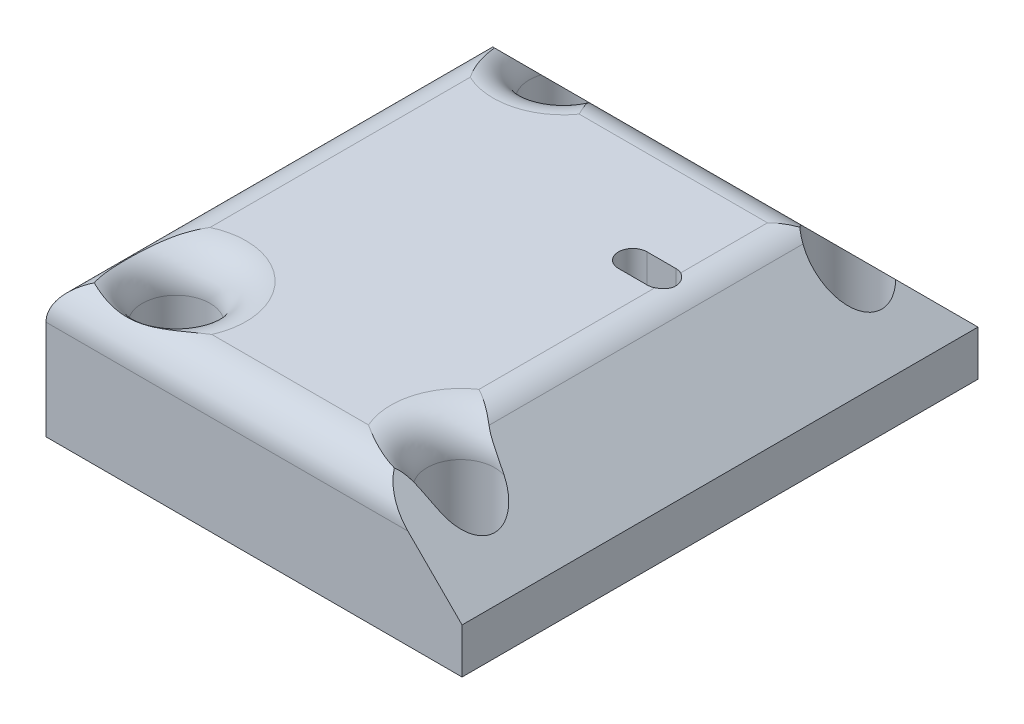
ISO-10303-21;
HEADER;
FILE_DESCRIPTION(('STEP AP214'),'2;1');
FILE_NAME('part.step','',(''),(''),'','','');
FILE_SCHEMA(('AUTOMOTIVE_DESIGN { 1 0 10303 214 1 1 1 1 }'));
ENDSEC;
DATA;
#1=APPLICATION_CONTEXT('core data for automotive mechanical design processes');
#2=APPLICATION_PROTOCOL_DEFINITION('international standard','automotive_design',2000,#1);
#3=PRODUCT_CONTEXT('',#1,'mechanical');
#4=PRODUCT('Part','Part','',(#3));
#5=PRODUCT_RELATED_PRODUCT_CATEGORY('part','',(#4));
#6=PRODUCT_DEFINITION_FORMATION('','',#4);
#7=PRODUCT_DEFINITION_CONTEXT('part definition',#1,'design');
#8=PRODUCT_DEFINITION('design','',#6,#7);
#9=PRODUCT_DEFINITION_SHAPE('','',#8);
#10=(LENGTH_UNIT() NAMED_UNIT(*) SI_UNIT(.MILLI.,.METRE.));
#11=(NAMED_UNIT(*) PLANE_ANGLE_UNIT() SI_UNIT($,.RADIAN.));
#12=(NAMED_UNIT(*) SI_UNIT($,.STERADIAN.) SOLID_ANGLE_UNIT());
#13=UNCERTAINTY_MEASURE_WITH_UNIT(LENGTH_MEASURE(1.E-05),#10,'distance_accuracy_value','');
#14=(GEOMETRIC_REPRESENTATION_CONTEXT(3) GLOBAL_UNCERTAINTY_ASSIGNED_CONTEXT((#13)) GLOBAL_UNIT_ASSIGNED_CONTEXT((#10,
#11,#12)) REPRESENTATION_CONTEXT('',''));
#15=CARTESIAN_POINT('',(0.,0.,0.));
#16=DIRECTION('',(0.,0.,1.));
#17=DIRECTION('',(1.,0.,0.));
#18=AXIS2_PLACEMENT_3D('',#15,#16,#17);
#19=CARTESIAN_POINT('',(46.0781497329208,-30.,57.1335578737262));
#20=DIRECTION('',(1.,0.,0.));
#21=DIRECTION('',(0.,0.,-1.));
#22=AXIS2_PLACEMENT_3D('',#19,#20,#21);
#23=PLANE('',#22);
#24=DIRECTION('',(0.,1.,0.));
#25=VECTOR('',#24,1.);
#26=CARTESIAN_POINT('',(46.0781497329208,-30.,-57.1335578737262));
#27=LINE('',#26,#25);
#28=CARTESIAN_POINT('',(46.0781497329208,-30.,-57.1335578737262));
#29=VERTEX_POINT('',#28);
#30=CARTESIAN_POINT('',(46.0781497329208,-20.,-57.1335578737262));
#31=VERTEX_POINT('',#30);
#32=EDGE_CURVE('E642',#29,#31,#27,.T.);
#33=ORIENTED_EDGE('',*,*,#32,.T.);
#34=DIRECTION('',(0.,0.,1.));
#35=VECTOR('',#34,1.);
#36=CARTESIAN_POINT('',(46.0781497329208,-20.,57.1335578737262));
#37=LINE('',#36,#35);
#38=CARTESIAN_POINT('',(46.0781497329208,-20.,57.1335578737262));
#39=VERTEX_POINT('',#38);
#40=EDGE_CURVE('E409',#31,#39,#37,.T.);
#41=ORIENTED_EDGE('',*,*,#40,.T.);
#42=DIRECTION('',(0.,1.,0.));
#43=VECTOR('',#42,1.);
#44=CARTESIAN_POINT('',(46.0781497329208,-30.,57.1335578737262));
#45=LINE('',#44,#43);
#46=CARTESIAN_POINT('',(46.0781497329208,-30.,57.1335578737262));
#47=VERTEX_POINT('',#46);
#48=EDGE_CURVE('E636',#47,#39,#45,.T.);
#49=ORIENTED_EDGE('',*,*,#48,.F.);
#50=DIRECTION('',(0.,0.,-1.));
#51=VECTOR('',#50,1.);
#52=CARTESIAN_POINT('',(46.0781497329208,-30.,57.1335578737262));
#53=LINE('',#52,#51);
#54=EDGE_CURVE('E660',#47,#29,#53,.T.);
#55=ORIENTED_EDGE('',*,*,#54,.T.);
#56=EDGE_LOOP('',(#33,#41,#49,#55));
#57=FACE_BOUND('',#56,.T.);
#58=ADVANCED_FACE('F125',(#57),#23,.T.);
#59=CARTESIAN_POINT('',(-46.0781497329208,-30.,57.1335578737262));
#60=DIRECTION('',(0.,0.,1.));
#61=DIRECTION('',(1.,0.,0.));
#62=AXIS2_PLACEMENT_3D('',#59,#60,#61);
#63=PLANE('',#62);
#64=DIRECTION('',(-0.707106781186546,0.707106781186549,0.));
#65=VECTOR('',#64,1.);
#66=CARTESIAN_POINT('',(5.00000000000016,21.0781497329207,57.1335578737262));
#67=LINE('',#66,#65);
#68=CARTESIAN_POINT('',(34.0781497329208,-8.,57.1335578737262));
#69=VERTEX_POINT('',#68);
#70=EDGE_CURVE('E413',#39,#69,#67,.T.);
#71=ORIENTED_EDGE('',*,*,#70,.T.);
#72=DIRECTION('',(1.,0.,0.));
#73=VECTOR('',#72,1.);
#74=CARTESIAN_POINT('',(-46.0781497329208,-8.,57.1335578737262));
#75=LINE('',#74,#73);
#76=CARTESIAN_POINT('',(-46.0781497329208,-8.,57.1335578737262));
#77=VERTEX_POINT('',#76);
#78=EDGE_CURVE('E582',#69,#77,#75,.F.);
#79=ORIENTED_EDGE('',*,*,#78,.T.);
#80=DIRECTION('',(0.,1.,0.));
#81=VECTOR('',#80,1.);
#82=CARTESIAN_POINT('',(-46.0781497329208,-30.,57.1335578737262));
#83=LINE('',#82,#81);
#84=CARTESIAN_POINT('',(-46.0781497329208,-30.,57.1335578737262));
#85=VERTEX_POINT('',#84);
#86=EDGE_CURVE('E638',#85,#77,#83,.T.);
#87=ORIENTED_EDGE('',*,*,#86,.F.);
#88=DIRECTION('',(1.,0.,0.));
#89=VECTOR('',#88,1.);
#90=CARTESIAN_POINT('',(-46.0781497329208,-30.,57.1335578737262));
#91=LINE('',#90,#89);
#92=EDGE_CURVE('E646',#85,#47,#91,.T.);
#93=ORIENTED_EDGE('',*,*,#92,.T.);
#94=ORIENTED_EDGE('',*,*,#48,.T.);
#95=EDGE_LOOP('',(#71,#79,#87,#93,#94));
#96=FACE_BOUND('',#95,.T.);
#97=ADVANCED_FACE('F467',(#96),#63,.T.);
#98=CARTESIAN_POINT('',(-46.0781497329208,-30.,57.1335578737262));
#99=DIRECTION('',(-1.,0.,0.));
#100=DIRECTION('',(0.,0.,1.));
#101=AXIS2_PLACEMENT_3D('',#98,#99,#100);
#102=PLANE('',#101);
#103=ORIENTED_EDGE('',*,*,#86,.T.);
#104=DIRECTION('',(0.,0.,1.));
#105=VECTOR('',#104,1.);
#106=CARTESIAN_POINT('',(-46.0781497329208,-8.,-37.1335578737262));
#107=LINE('',#106,#105);
#108=CARTESIAN_POINT('',(-46.0781497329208,-8.,-45.1335578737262));
#109=VERTEX_POINT('',#108);
#110=EDGE_CURVE('E586',#77,#109,#107,.F.);
#111=ORIENTED_EDGE('',*,*,#110,.T.);
#112=DIRECTION('',(0.,-0.707106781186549,-0.707106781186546));
#113=VECTOR('',#112,1.);
#114=CARTESIAN_POINT('',(-46.0781497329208,32.1335578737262,-5.00000000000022));
#115=LINE('',#114,#113);
#116=CARTESIAN_POINT('',(-46.0781497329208,-20.,-57.1335578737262));
#117=VERTEX_POINT('',#116);
#118=EDGE_CURVE('E635',#109,#117,#115,.T.);
#119=ORIENTED_EDGE('',*,*,#118,.T.);
#120=DIRECTION('',(0.,1.,0.));
#121=VECTOR('',#120,1.);
#122=CARTESIAN_POINT('',(-46.0781497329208,-30.,-57.1335578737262));
#123=LINE('',#122,#121);
#124=CARTESIAN_POINT('',(-46.0781497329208,-30.,-57.1335578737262));
#125=VERTEX_POINT('',#124);
#126=EDGE_CURVE('E645',#125,#117,#123,.T.);
#127=ORIENTED_EDGE('',*,*,#126,.F.);
#128=DIRECTION('',(0.,0.,1.));
#129=VECTOR('',#128,1.);
#130=CARTESIAN_POINT('',(-46.0781497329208,-30.,57.1335578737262));
#131=LINE('',#130,#129);
#132=EDGE_CURVE('E654',#125,#85,#131,.T.);
#133=ORIENTED_EDGE('',*,*,#132,.T.);
#134=EDGE_LOOP('',(#103,#111,#119,#127,#133));
#135=FACE_BOUND('',#134,.T.);
#136=ADVANCED_FACE('F470',(#135),#102,.T.);
#137=CARTESIAN_POINT('',(-46.0781497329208,-30.,-57.1335578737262));
#138=DIRECTION('',(0.,0.,-1.));
#139=DIRECTION('',(-1.,0.,0.));
#140=AXIS2_PLACEMENT_3D('',#137,#138,#139);
#141=PLANE('',#140);
#142=ORIENTED_EDGE('',*,*,#126,.T.);
#143=DIRECTION('',(1.,0.,0.));
#144=VECTOR('',#143,1.);
#145=CARTESIAN_POINT('',(46.0781497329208,-20.,-57.1335578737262));
#146=LINE('',#145,#144);
#147=EDGE_CURVE('E410',#117,#31,#146,.T.);
#148=ORIENTED_EDGE('',*,*,#147,.T.);
#149=ORIENTED_EDGE('',*,*,#32,.F.);
#150=DIRECTION('',(-1.,0.,0.));
#151=VECTOR('',#150,1.);
#152=CARTESIAN_POINT('',(-46.0781497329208,-30.,-57.1335578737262));
#153=LINE('',#152,#151);
#154=EDGE_CURVE('E657',#29,#125,#153,.T.);
#155=ORIENTED_EDGE('',*,*,#154,.T.);
#156=EDGE_LOOP('',(#142,#148,#149,#155));
#157=FACE_BOUND('',#156,.T.);
#158=ADVANCED_FACE('F463',(#157),#141,.T.);
#159=CARTESIAN_POINT('',(0.,-30.,0.));
#160=DIRECTION('',(0.,-1.,0.));
#161=DIRECTION('',(0.,0.,-1.));
#162=AXIS2_PLACEMENT_3D('',#159,#160,#161);
#163=PLANE('',#162);
#164=CARTESIAN_POINT('',(21.3543367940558,-30.,-11.7391650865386));
#165=DIRECTION('',(0.,-1.,0.));
#166=DIRECTION('',(0.,0.,-1.));
#167=AXIS2_PLACEMENT_3D('',#164,#165,#166);
#168=CIRCLE('',#167,3.17499999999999);
#169=CARTESIAN_POINT('',(21.3543367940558,-30.,-14.9141650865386));
#170=VERTEX_POINT('',#169);
#171=CARTESIAN_POINT('',(21.3543367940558,-30.,-8.56416508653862));
#172=VERTEX_POINT('',#171);
#173=EDGE_CURVE('E290',#170,#172,#168,.T.);
#174=ORIENTED_EDGE('',*,*,#173,.F.);
#175=DIRECTION('',(1.,0.,0.));
#176=VECTOR('',#175,1.);
#177=CARTESIAN_POINT('',(15.0043367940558,-30.,-14.9141650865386));
#178=LINE('',#177,#176);
#179=CARTESIAN_POINT('',(15.0043367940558,-30.,-14.9141650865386));
#180=VERTEX_POINT('',#179);
#181=EDGE_CURVE('E296',#180,#170,#178,.T.);
#182=ORIENTED_EDGE('',*,*,#181,.F.);
#183=CARTESIAN_POINT('',(15.0043367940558,-30.,-11.7391650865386));
#184=DIRECTION('',(0.,-1.,0.));
#185=DIRECTION('',(0.,0.,-1.));
#186=AXIS2_PLACEMENT_3D('',#183,#184,#185);
#187=CIRCLE('',#186,3.17499999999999);
#188=CARTESIAN_POINT('',(15.0043367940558,-30.,-8.56416508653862));
#189=VERTEX_POINT('',#188);
#190=EDGE_CURVE('E148',#189,#180,#187,.T.);
#191=ORIENTED_EDGE('',*,*,#190,.F.);
#192=DIRECTION('',(1.,0.,0.));
#193=VECTOR('',#192,1.);
#194=CARTESIAN_POINT('',(15.0043367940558,-30.,-8.56416508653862));
#195=LINE('',#194,#193);
#196=EDGE_CURVE('E274',#189,#172,#195,.T.);
#197=ORIENTED_EDGE('',*,*,#196,.T.);
#198=EDGE_LOOP('',(#174,#182,#191,#197));
#199=FACE_BOUND('',#198,.T.);
#200=CARTESIAN_POINT('',(31.5268198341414,-30.,42.8582864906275));
#201=DIRECTION('',(0.,1.,0.));
#202=DIRECTION('',(0.,0.,1.));
#203=AXIS2_PLACEMENT_3D('',#200,#201,#202);
#204=CIRCLE('',#203,7.5);
#205=CARTESIAN_POINT('',(31.5268198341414,-30.,50.3582864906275));
#206=VERTEX_POINT('',#205);
#207=EDGE_CURVE('E389',#206,#206,#204,.T.);
#208=ORIENTED_EDGE('',*,*,#207,.T.);
#209=EDGE_LOOP('',(#208));
#210=FACE_BOUND('',#209,.T.);
#211=CARTESIAN_POINT('',(-31.5268198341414,-30.,-42.8582864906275));
#212=DIRECTION('',(0.,1.,0.));
#213=DIRECTION('',(0.,0.,1.));
#214=AXIS2_PLACEMENT_3D('',#211,#212,#213);
#215=CIRCLE('',#214,7.5);
#216=CARTESIAN_POINT('',(-31.5268198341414,-30.,-35.3582864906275));
#217=VERTEX_POINT('',#216);
#218=EDGE_CURVE('E387',#217,#217,#215,.T.);
#219=ORIENTED_EDGE('',*,*,#218,.T.);
#220=EDGE_LOOP('',(#219));
#221=FACE_BOUND('',#220,.T.);
#222=CARTESIAN_POINT('',(-31.5268198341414,-30.,42.8582864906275));
#223=DIRECTION('',(0.,1.,0.));
#224=DIRECTION('',(0.,0.,1.));
#225=AXIS2_PLACEMENT_3D('',#222,#223,#224);
#226=CIRCLE('',#225,7.5);
#227=CARTESIAN_POINT('',(-31.5268198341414,-30.,50.3582864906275));
#228=VERTEX_POINT('',#227);
#229=EDGE_CURVE('E383',#228,#228,#226,.T.);
#230=ORIENTED_EDGE('',*,*,#229,.T.);
#231=EDGE_LOOP('',(#230));
#232=FACE_BOUND('',#231,.T.);
#233=CARTESIAN_POINT('',(31.5268198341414,-30.,-42.8582864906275));
#234=DIRECTION('',(0.,1.,0.));
#235=DIRECTION('',(0.,0.,1.));
#236=AXIS2_PLACEMENT_3D('',#233,#234,#235);
#237=CIRCLE('',#236,7.5);
#238=CARTESIAN_POINT('',(31.5268198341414,-30.,-35.3582864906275));
#239=VERTEX_POINT('',#238);
#240=EDGE_CURVE('E421',#239,#239,#237,.T.);
#241=ORIENTED_EDGE('',*,*,#240,.T.);
#242=EDGE_LOOP('',(#241));
#243=FACE_BOUND('',#242,.T.);
#244=ORIENTED_EDGE('',*,*,#54,.F.);
#245=ORIENTED_EDGE('',*,*,#92,.F.);
#246=ORIENTED_EDGE('',*,*,#132,.F.);
#247=ORIENTED_EDGE('',*,*,#154,.F.);
#248=EDGE_LOOP('',(#244,#245,#246,#247));
#249=FACE_BOUND('',#248,.T.);
#250=ADVANCED_FACE('F294',(#199,#210,#221,#232,#243,#249),#163,.T.);
#251=CARTESIAN_POINT('',(0.,0.,0.));
#252=DIRECTION('',(0.,-1.,0.));
#253=DIRECTION('',(0.,0.,-1.));
#254=AXIS2_PLACEMENT_3D('',#251,#252,#253);
#255=PLANE('',#254);
#256=DIRECTION('',(1.,0.,0.));
#257=VECTOR('',#256,1.);
#258=CARTESIAN_POINT('',(15.0043367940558,0.,-14.9141650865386));
#259=LINE('',#258,#257);
#260=CARTESIAN_POINT('',(15.0043367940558,0.,-14.9141650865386));
#261=VERTEX_POINT('',#260);
#262=CARTESIAN_POINT('',(21.3543367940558,0.,-14.9141650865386));
#263=VERTEX_POINT('',#262);
#264=EDGE_CURVE('E332',#261,#263,#259,.T.);
#265=ORIENTED_EDGE('',*,*,#264,.T.);
#266=CARTESIAN_POINT('',(21.3543367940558,0.,-11.7391650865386));
#267=DIRECTION('',(0.,-1.,0.));
#268=DIRECTION('',(0.,0.,-1.));
#269=AXIS2_PLACEMENT_3D('',#266,#267,#268);
#270=CIRCLE('',#269,3.175);
#271=CARTESIAN_POINT('',(22.7644412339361,0.,-14.5838496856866));
#272=VERTEX_POINT('',#271);
#273=EDGE_CURVE('E318',#263,#272,#270,.T.);
#274=ORIENTED_EDGE('',*,*,#273,.T.);
#275=DIRECTION('',(0.,0.,-1.));
#276=VECTOR('',#275,1.);
#277=CARTESIAN_POINT('',(22.7644412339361,0.,-37.1335578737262));
#278=LINE('',#277,#276);
#279=CARTESIAN_POINT('',(22.7644412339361,0.,-33.8198493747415));
#280=VERTEX_POINT('',#279);
#281=EDGE_CURVE('E612',#272,#280,#278,.T.);
#282=ORIENTED_EDGE('',*,*,#281,.T.);
#283=DIRECTION('',(-1.,0.,0.));
#284=VECTOR('',#283,1.);
#285=CARTESIAN_POINT('',(-26.6814630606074,0.,-33.8198493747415));
#286=LINE('',#285,#284);
#287=CARTESIAN_POINT('',(-18.9348916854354,0.,-33.8198493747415));
#288=VERTEX_POINT('',#287);
#289=EDGE_CURVE('E618',#280,#288,#286,.T.);
#290=ORIENTED_EDGE('',*,*,#289,.T.);
#291=CARTESIAN_POINT('',(-31.5268198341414,0.,-42.8582864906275));
#292=DIRECTION('',(0.,-1.,0.));
#293=DIRECTION('',(0.,0.,-1.));
#294=AXIS2_PLACEMENT_3D('',#291,#292,#293);
#295=CIRCLE('',#294,15.5);
#296=CARTESIAN_POINT('',(-38.0781497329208,0.,-28.8108640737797));
#297=VERTEX_POINT('',#296);
#298=EDGE_CURVE('E553',#288,#297,#295,.T.);
#299=ORIENTED_EDGE('',*,*,#298,.T.);
#300=DIRECTION('',(0.,0.,1.));
#301=VECTOR('',#300,1.);
#302=CARTESIAN_POINT('',(-38.0781497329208,0.,57.1335578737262));
#303=LINE('',#302,#301);
#304=CARTESIAN_POINT('',(-38.0781497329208,0.,28.8108640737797));
#305=VERTEX_POINT('',#304);
#306=EDGE_CURVE('E610',#297,#305,#303,.T.);
#307=ORIENTED_EDGE('',*,*,#306,.T.);
#308=CARTESIAN_POINT('',(-31.5268198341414,0.,42.8582864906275));
#309=DIRECTION('',(0.,-1.,0.));
#310=DIRECTION('',(0.,0.,-1.));
#311=AXIS2_PLACEMENT_3D('',#308,#309,#310);
#312=CIRCLE('',#311,15.5);
#313=CARTESIAN_POINT('',(-17.3539242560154,0.,49.1335578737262));
#314=VERTEX_POINT('',#313);
#315=EDGE_CURVE('E575',#305,#314,#312,.T.);
#316=ORIENTED_EDGE('',*,*,#315,.T.);
#317=DIRECTION('',(1.,0.,0.));
#318=VECTOR('',#317,1.);
#319=CARTESIAN_POINT('',(26.0781497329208,0.,49.1335578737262));
#320=LINE('',#319,#318);
#321=CARTESIAN_POINT('',(17.3539242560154,0.,49.1335578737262));
#322=VERTEX_POINT('',#321);
#323=EDGE_CURVE('E604',#314,#322,#320,.T.);
#324=ORIENTED_EDGE('',*,*,#323,.T.);
#325=CARTESIAN_POINT('',(31.5268198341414,0.,42.8582864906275));
#326=DIRECTION('',(0.,-1.,0.));
#327=DIRECTION('',(0.,0.,-1.));
#328=AXIS2_PLACEMENT_3D('',#325,#326,#327);
#329=CIRCLE('',#328,15.5);
#330=CARTESIAN_POINT('',(22.7644412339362,0.,30.0727195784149));
#331=VERTEX_POINT('',#330);
#332=EDGE_CURVE('E609',#322,#331,#329,.T.);
#333=ORIENTED_EDGE('',*,*,#332,.T.);
#334=CARTESIAN_POINT('',(22.7644412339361,0.,-8.89448048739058));
#335=VERTEX_POINT('',#334);
#336=EDGE_CURVE('E616',#331,#335,#278,.T.);
#337=ORIENTED_EDGE('',*,*,#336,.T.);
#338=CARTESIAN_POINT('',(21.3543367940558,0.,-8.56416508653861));
#339=VERTEX_POINT('',#338);
#340=EDGE_CURVE('E155',#335,#339,#270,.T.);
#341=ORIENTED_EDGE('',*,*,#340,.T.);
#342=DIRECTION('',(1.,0.,0.));
#343=VECTOR('',#342,1.);
#344=CARTESIAN_POINT('',(15.0043367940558,0.,-8.56416508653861));
#345=LINE('',#344,#343);
#346=CARTESIAN_POINT('',(15.0043367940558,0.,-8.56416508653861));
#347=VERTEX_POINT('',#346);
#348=EDGE_CURVE('E283',#347,#339,#345,.T.);
#349=ORIENTED_EDGE('',*,*,#348,.F.);
#350=CARTESIAN_POINT('',(15.0043367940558,0.,-11.7391650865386));
#351=DIRECTION('',(0.,-1.,0.));
#352=DIRECTION('',(0.,0.,-1.));
#353=AXIS2_PLACEMENT_3D('',#350,#351,#352);
#354=CIRCLE('',#353,3.175);
#355=EDGE_CURVE('E287',#347,#261,#354,.T.);
#356=ORIENTED_EDGE('',*,*,#355,.T.);
#357=EDGE_LOOP('',(#265,#274,#282,#290,#299,#307,#316,#324,#333,#337,#341,#349,#356));
#358=FACE_BOUND('',#357,.T.);
#359=ADVANCED_FACE('F456',(#358),#255,.F.);
#360=CARTESIAN_POINT('',(31.5268198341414,-30.,-42.8582864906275));
#361=DIRECTION('',(0.,1.,0.));
#362=DIRECTION('',(0.,0.,1.));
#363=AXIS2_PLACEMENT_3D('',#360,#361,#362);
#364=CYLINDRICAL_SURFACE('',#363,7.5);
#365=ORIENTED_EDGE('',*,*,#240,.F.);
#366=EDGE_LOOP('',(#365));
#367=FACE_BOUND('',#366,.T.);
#368=CARTESIAN_POINT('',(31.5268198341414,-5.72472861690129,-42.8582864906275));
#369=DIRECTION('',(0.,0.707106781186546,-0.707106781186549));
#370=DIRECTION('',(0.,0.707106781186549,0.707106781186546));
#371=AXIS2_PLACEMENT_3D('',#368,#369,#370);
#372=ELLIPSE('',#371,10.6066017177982,7.5);
#373=CARTESIAN_POINT('',(36.9663533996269,-10.8882036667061,-48.0217615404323));
#374=VERTEX_POINT('',#373);
#375=CARTESIAN_POINT('',(24.832426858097,-2.34314575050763,-39.4767036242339));
#376=VERTEX_POINT('',#375);
#377=EDGE_CURVE('E393',#374,#376,#372,.T.);
#378=ORIENTED_EDGE('',*,*,#377,.T.);
#379=CARTESIAN_POINT('',(24.832426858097,-2.34314575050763,-39.4767036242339));
#380=CARTESIAN_POINT('',(24.8904520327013,-2.22815505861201,-39.3617763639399));
#381=CARTESIAN_POINT('',(24.9534267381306,-2.11796334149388,-39.2445153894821));
#382=CARTESIAN_POINT('',(25.08971434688,-1.90751694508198,-39.0070106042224));
#383=CARTESIAN_POINT('',(25.1630319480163,-1.80726681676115,-38.886765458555));
#384=CARTESIAN_POINT('',(25.3187660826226,-1.61911300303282,-38.6475825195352));
#385=CARTESIAN_POINT('',(25.4009632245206,-1.5309969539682,-38.5286690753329));
#386=CARTESIAN_POINT('',(25.5756705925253,-1.36484761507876,-38.291504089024));
#387=CARTESIAN_POINT('',(25.66817505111,-1.2868087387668,-38.1732522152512));
#388=CARTESIAN_POINT('',(25.8563015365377,-1.14592452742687,-37.947565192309));
#389=CARTESIAN_POINT('',(25.9512124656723,-1.08238812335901,-37.8399669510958));
#390=CARTESIAN_POINT('',(26.1504331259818,-0.962920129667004,-37.6270289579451));
#391=CARTESIAN_POINT('',(26.2548255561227,-0.907068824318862,-37.5217215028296));
#392=CARTESIAN_POINT('',(26.3633447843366,-0.85521916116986,-37.418752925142));
#393=B_SPLINE_CURVE_WITH_KNOTS('',3,(#379,#380,#381,#382,#383,#384,#385,#386,#387,#388,#389,
#390,#391,#392),.UNSPECIFIED.,.F.,.F.,(4,2,2,2,2,2,4),(0.,0.517746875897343,1.03572967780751,
1.54300612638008,2.05000013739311,2.52027244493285,2.99513508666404),.UNSPECIFIED.);
#394=CARTESIAN_POINT('',(26.3633447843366,-0.85521916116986,-37.418752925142));
#395=VERTEX_POINT('',#394);
#396=EDGE_CURVE('E428',#376,#395,#393,.T.);
#397=ORIENTED_EDGE('',*,*,#396,.T.);
#398=CARTESIAN_POINT('',(26.3633447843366,-0.85521916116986,-37.418752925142));
#399=CARTESIAN_POINT('',(26.4809847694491,-0.914442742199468,-37.3070205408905));
#400=CARTESIAN_POINT('',(26.601017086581,-0.978577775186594,-37.2003984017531));
#401=CARTESIAN_POINT('',(26.8441145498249,-1.11699850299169,-36.9976428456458));
#402=CARTESIAN_POINT('',(26.9671804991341,-1.19128691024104,-36.9015122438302));
#403=CARTESIAN_POINT('',(27.2120610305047,-1.3487243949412,-36.7218781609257));
#404=CARTESIAN_POINT('',(27.3338515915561,-1.43166711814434,-36.6381610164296));
#405=CARTESIAN_POINT('',(27.5768059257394,-1.60753441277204,-36.4811169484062));
#406=CARTESIAN_POINT('',(27.6979699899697,-1.7004538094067,-36.4077846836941));
#407=CARTESIAN_POINT('',(27.920412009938,-1.88171546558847,-36.2812270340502));
#408=CARTESIAN_POINT('',(28.0219990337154,-1.96872851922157,-36.2266302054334));
#409=CARTESIAN_POINT('',(28.2234409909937,-2.15038780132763,-36.1240002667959));
#410=CARTESIAN_POINT('',(28.3232732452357,-2.24509371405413,-36.076028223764));
#411=CARTESIAN_POINT('',(28.4212954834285,-2.34314575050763,-36.0314483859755));
#412=B_SPLINE_CURVE_WITH_KNOTS('',3,(#398,#399,#400,#401,#402,#403,#404,#405,#406,#407,#408,
#409,#410,#411),.UNSPECIFIED.,.F.,.F.,(4,2,2,2,2,2,4),(0.,0.51800326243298,1.03614517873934,
1.54394942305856,2.05149153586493,2.48455566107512,2.92137765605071),.UNSPECIFIED.);
#413=CARTESIAN_POINT('',(28.4212954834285,-2.34314575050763,-36.0314483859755));
#414=VERTEX_POINT('',#413);
#415=EDGE_CURVE('E438',#395,#414,#412,.T.);
#416=ORIENTED_EDGE('',*,*,#415,.T.);
#417=CARTESIAN_POINT('',(31.5268198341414,-5.4486701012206,-42.8582864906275));
#418=DIRECTION('',(0.707106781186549,0.707106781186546,0.));
#419=DIRECTION('',(-0.707106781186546,0.707106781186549,0.));
#420=AXIS2_PLACEMENT_3D('',#417,#418,#419);
#421=ELLIPSE('',#420,10.6066017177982,7.5);
#422=EDGE_CURVE('E416',#414,#374,#421,.T.);
#423=ORIENTED_EDGE('',*,*,#422,.T.);
#424=EDGE_LOOP('',(#378,#397,#416,#423));
#425=FACE_BOUND('',#424,.T.);
#426=ADVANCED_FACE('F450',(#367,#425),#364,.F.);
#427=CARTESIAN_POINT('',(-31.5268198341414,-30.,42.8582864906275));
#428=DIRECTION('',(0.,1.,0.));
#429=DIRECTION('',(0.,0.,1.));
#430=AXIS2_PLACEMENT_3D('',#427,#428,#429);
#431=CYLINDRICAL_SURFACE('',#430,7.5);
#432=CARTESIAN_POINT('',(-31.5268198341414,-8.,42.8582864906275));
#433=DIRECTION('',(0.,-1.,0.));
#434=DIRECTION('',(0.,0.,-1.));
#435=AXIS2_PLACEMENT_3D('',#432,#433,#434);
#436=CIRCLE('',#435,7.5);
#437=CARTESIAN_POINT('',(-31.5268198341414,-8.,35.3582864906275));
#438=VERTEX_POINT('',#437);
#439=EDGE_CURVE('E141',#438,#438,#436,.F.);
#440=ORIENTED_EDGE('',*,*,#439,.T.);
#441=EDGE_LOOP('',(#440));
#442=FACE_BOUND('',#441,.T.);
#443=ORIENTED_EDGE('',*,*,#229,.F.);
#444=EDGE_LOOP('',(#443));
#445=FACE_BOUND('',#444,.T.);
#446=ADVANCED_FACE('F455',(#442,#445),#431,.F.);
#447=CARTESIAN_POINT('',(-31.5268198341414,-30.,-42.8582864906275));
#448=DIRECTION('',(0.,1.,0.));
#449=DIRECTION('',(0.,0.,1.));
#450=AXIS2_PLACEMENT_3D('',#447,#448,#449);
#451=CYLINDRICAL_SURFACE('',#450,7.5);
#452=ORIENTED_EDGE('',*,*,#218,.F.);
#453=EDGE_LOOP('',(#452));
#454=FACE_BOUND('',#453,.T.);
#455=CARTESIAN_POINT('',(-31.5268198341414,-5.72472861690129,-42.8582864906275));
#456=DIRECTION('',(0.,0.707106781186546,-0.707106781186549));
#457=DIRECTION('',(0.,0.707106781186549,0.707106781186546));
#458=AXIS2_PLACEMENT_3D('',#455,#456,#457);
#459=ELLIPSE('',#458,10.6066017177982,7.5);
#460=CARTESIAN_POINT('',(-24.3802724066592,-8.,-45.1335578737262));
#461=VERTEX_POINT('',#460);
#462=CARTESIAN_POINT('',(-38.6733672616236,-8.,-45.1335578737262));
#463=VERTEX_POINT('',#462);
#464=EDGE_CURVE('E632',#461,#463,#459,.T.);
#465=ORIENTED_EDGE('',*,*,#464,.T.);
#466=CARTESIAN_POINT('',(-31.5268198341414,-8.,-42.8582864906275));
#467=DIRECTION('',(0.,-1.,0.));
#468=DIRECTION('',(0.,0.,-1.));
#469=AXIS2_PLACEMENT_3D('',#466,#467,#468);
#470=CIRCLE('',#469,7.5);
#471=EDGE_CURVE('E590',#463,#461,#470,.F.);
#472=ORIENTED_EDGE('',*,*,#471,.T.);
#473=EDGE_LOOP('',(#465,#472));
#474=FACE_BOUND('',#473,.T.);
#475=ADVANCED_FACE('F458',(#454,#474),#451,.F.);
#476=CARTESIAN_POINT('',(31.5268198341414,-30.,42.8582864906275));
#477=DIRECTION('',(0.,1.,0.));
#478=DIRECTION('',(0.,0.,1.));
#479=AXIS2_PLACEMENT_3D('',#476,#477,#478);
#480=CYLINDRICAL_SURFACE('',#479,7.5);
#481=ORIENTED_EDGE('',*,*,#207,.F.);
#482=EDGE_LOOP('',(#481));
#483=FACE_BOUND('',#482,.T.);
#484=CARTESIAN_POINT('',(31.5268198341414,-5.4486701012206,42.8582864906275));
#485=DIRECTION('',(0.707106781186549,0.707106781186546,0.));
#486=DIRECTION('',(-0.707106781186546,0.707106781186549,0.));
#487=AXIS2_PLACEMENT_3D('',#484,#485,#486);
#488=ELLIPSE('',#487,10.6066017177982,7.5);
#489=CARTESIAN_POINT('',(34.0781497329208,-8.,49.9109963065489));
#490=VERTEX_POINT('',#489);
#491=CARTESIAN_POINT('',(34.0781497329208,-8.,35.8055766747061));
#492=VERTEX_POINT('',#491);
#493=EDGE_CURVE('E404',#490,#492,#488,.T.);
#494=ORIENTED_EDGE('',*,*,#493,.T.);
#495=CARTESIAN_POINT('',(31.5268198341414,-8.,42.8582864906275));
#496=DIRECTION('',(0.,-1.,0.));
#497=DIRECTION('',(0.,0.,-1.));
#498=AXIS2_PLACEMENT_3D('',#495,#496,#497);
#499=CIRCLE('',#498,7.5);
#500=EDGE_CURVE('E579',#492,#490,#499,.F.);
#501=ORIENTED_EDGE('',*,*,#500,.T.);
#502=EDGE_LOOP('',(#494,#501));
#503=FACE_BOUND('',#502,.T.);
#504=ADVANCED_FACE('F484',(#483,#503),#480,.F.);
#505=CARTESIAN_POINT('',(26.0781497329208,0.,0.));
#506=DIRECTION('',(0.707106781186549,0.707106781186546,0.));
#507=DIRECTION('',(0.,0.,1.));
#508=AXIS2_PLACEMENT_3D('',#505,#506,#507);
#509=PLANE('',#508);
#510=ORIENTED_EDGE('',*,*,#422,.F.);
#511=DIRECTION('',(0.,0.,-1.));
#512=VECTOR('',#511,1.);
#513=CARTESIAN_POINT('',(28.4212954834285,-2.34314575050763,37.7044535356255));
#514=LINE('',#513,#512);
#515=CARTESIAN_POINT('',(28.4212954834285,-2.34314575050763,33.5178776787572));
#516=VERTEX_POINT('',#515);
#517=EDGE_CURVE('E500',#414,#516,#514,.F.);
#518=ORIENTED_EDGE('',*,*,#517,.T.);
#519=CARTESIAN_POINT('',(28.4212954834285,-2.34314575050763,33.5178776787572));
#520=CARTESIAN_POINT('',(28.5314774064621,-2.45332767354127,33.5973354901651));
#521=CARTESIAN_POINT('',(28.6432451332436,-2.56509540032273,33.6722089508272));
#522=CARTESIAN_POINT('',(28.8691851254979,-2.79103539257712,33.8139469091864));
#523=CARTESIAN_POINT('',(28.9833552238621,-2.9052054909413,33.880818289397));
#524=CARTESIAN_POINT('',(29.213150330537,-3.13500059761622,34.0076378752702));
#525=CARTESIAN_POINT('',(29.3287693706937,-3.25061963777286,34.0676079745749));
#526=CARTESIAN_POINT('',(29.5613853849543,-3.4832356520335,34.1820396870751));
#527=CARTESIAN_POINT('',(29.6783826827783,-3.60023294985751,34.2364999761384));
#528=CARTESIAN_POINT('',(29.9130740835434,-3.83492435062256,34.3408278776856));
#529=CARTESIAN_POINT('',(30.0307657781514,-3.95261604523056,34.3907064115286));
#530=CARTESIAN_POINT('',(30.2668658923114,-4.18871615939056,34.4869619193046));
#531=CARTESIAN_POINT('',(30.3852743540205,-4.30712462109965,34.5333386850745));
#532=CARTESIAN_POINT('',(30.7414527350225,-4.66330300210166,34.6685777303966));
#533=CARTESIAN_POINT('',(30.9799724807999,-4.90182274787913,34.7534618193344));
#534=CARTESIAN_POINT('',(31.4567892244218,-5.37863949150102,34.9177521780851));
#535=CARTESIAN_POINT('',(31.6950823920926,-5.61693265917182,34.9971813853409));
#536=CARTESIAN_POINT('',(32.1717507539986,-6.09360102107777,35.1549151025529));
#537=CARTESIAN_POINT('',(32.4101258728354,-6.33197613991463,35.233220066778));
#538=CARTESIAN_POINT('',(32.7677257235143,-6.68957599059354,35.3520308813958));
#539=CARTESIAN_POINT('',(32.8870556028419,-6.80890586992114,35.3919020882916));
#540=CARTESIAN_POINT('',(33.1256022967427,-7.0474525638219,35.4723132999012));
#541=CARTESIAN_POINT('',(33.244819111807,-7.16666937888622,35.5128533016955));
#542=CARTESIAN_POINT('',(33.4831593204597,-7.40500958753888,35.5948273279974));
#543=CARTESIAN_POINT('',(33.6022826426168,-7.52413290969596,35.6362617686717));
#544=CARTESIAN_POINT('',(33.8403544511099,-7.76220471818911,35.7201345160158));
#545=CARTESIAN_POINT('',(33.9593029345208,-7.88115320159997,35.7625728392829));
#546=CARTESIAN_POINT('',(34.0781497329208,-7.99999999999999,35.8055766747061));
#547=B_SPLINE_CURVE_WITH_KNOTS('',3,(#519,#520,#521,#522,#523,#524,#525,#526,#527,#528,#529,
#530,#531,#532,#533,#534,#535,#536,#537,#538,#539,#540,#541,#542,#543,#544,#545,#546),
.UNSPECIFIED.,.F.,.F.,(4,2,2,2,2,2,2,2,2,2,2,2,2,4),(0.,0.524534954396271,1.04861546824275,
1.57098467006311,2.09347911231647,2.61469390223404,3.13593965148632,4.17933121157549,
5.2180261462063,6.256288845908,6.77649996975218,7.29670882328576,7.81716517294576,
8.33763013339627),.UNSPECIFIED.);
#548=EDGE_CURVE('E494',#516,#492,#547,.T.);
#549=ORIENTED_EDGE('',*,*,#548,.T.);
#550=ORIENTED_EDGE('',*,*,#493,.F.);
#551=CARTESIAN_POINT('',(34.0781497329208,-8.,49.9109963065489));
#552=CARTESIAN_POINT('',(33.9540222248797,-7.87587249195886,49.9559124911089));
#553=CARTESIAN_POINT('',(33.8297834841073,-7.75163375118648,50.0002097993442));
#554=CARTESIAN_POINT('',(33.5811166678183,-7.50296693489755,50.0877152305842));
#555=CARTESIAN_POINT('',(33.4566885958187,-7.37853886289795,50.1309233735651));
#556=CARTESIAN_POINT('',(33.2076637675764,-7.12951403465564,50.2164033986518));
#557=CARTESIAN_POINT('',(33.0830670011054,-7.00491726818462,50.2586752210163));
#558=CARTESIAN_POINT('',(32.8337558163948,-6.75560608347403,50.3425223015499));
#559=CARTESIAN_POINT('',(32.709041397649,-6.63089166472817,50.3840975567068));
#560=CARTESIAN_POINT('',(32.3289074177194,-6.25075768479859,50.510163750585));
#561=CARTESIAN_POINT('',(32.0733812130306,-5.99523148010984,50.5940025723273));
#562=CARTESIAN_POINT('',(31.5626594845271,-5.4845097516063,50.7635305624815));
#563=CARTESIAN_POINT('',(31.3074639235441,-5.2293141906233,50.8492194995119));
#564=CARTESIAN_POINT('',(30.9253285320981,-4.8471787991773,50.9831904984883));
#565=CARTESIAN_POINT('',(30.7979253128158,-4.71977557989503,51.0288049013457));
#566=CARTESIAN_POINT('',(30.5436087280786,-4.4654589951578,51.1226776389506));
#567=CARTESIAN_POINT('',(30.4166953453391,-4.33854561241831,51.1709358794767));
#568=CARTESIAN_POINT('',(30.1634645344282,-4.0853148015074,51.2711024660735));
#569=CARTESIAN_POINT('',(30.0371477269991,-3.9589979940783,51.3230139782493));
#570=CARTESIAN_POINT('',(29.7855371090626,-3.70738737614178,51.4315553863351));
#571=CARTESIAN_POINT('',(29.6602432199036,-3.58209348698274,51.4881849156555));
#572=CARTESIAN_POINT('',(29.4123496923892,-3.33419995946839,51.606810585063));
#573=CARTESIAN_POINT('',(29.2897355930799,-3.21158586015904,51.6687452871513));
#574=CARTESIAN_POINT('',(29.0464492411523,-2.96829950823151,51.7997870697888));
#575=CARTESIAN_POINT('',(28.9257772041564,-2.84762747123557,51.8688949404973));
#576=CARTESIAN_POINT('',(28.5680626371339,-2.48991290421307,52.0889234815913));
#577=CARTESIAN_POINT('',(28.3347331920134,-2.25658345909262,52.2528143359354));
#578=CARTESIAN_POINT('',(28.0124956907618,-1.93434595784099,52.521056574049));
#579=CARTESIAN_POINT('',(27.915976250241,-1.83782651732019,52.6072558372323));
#580=CARTESIAN_POINT('',(27.7274358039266,-1.64928607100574,52.7890785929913));
#581=CARTESIAN_POINT('',(27.6354150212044,-1.55726528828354,52.8847025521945));
#582=CARTESIAN_POINT('',(27.4569989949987,-1.37884926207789,53.0856865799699));
#583=CARTESIAN_POINT('',(27.3705975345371,-1.29244780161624,53.191035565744));
#584=CARTESIAN_POINT('',(27.204349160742,-1.12619942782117,53.4116403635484));
#585=CARTESIAN_POINT('',(27.1245019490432,-1.04635221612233,53.5268957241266));
#586=CARTESIAN_POINT('',(26.9717796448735,-0.893629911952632,53.7678973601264));
#587=CARTESIAN_POINT('',(26.8989614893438,-0.820811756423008,53.8937160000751));
#588=CARTESIAN_POINT('',(26.7618578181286,-0.683708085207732,54.1543489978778));
#589=CARTESIAN_POINT('',(26.6975725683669,-0.6194228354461,54.2891636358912));
#590=CARTESIAN_POINT('',(26.5780400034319,-0.49989027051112,54.5670738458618));
#591=CARTESIAN_POINT('',(26.5228171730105,-0.444667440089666,54.7101904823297));
#592=CARTESIAN_POINT('',(26.4220334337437,-0.34388370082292,55.0030555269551));
#593=CARTESIAN_POINT('',(26.3764718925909,-0.298322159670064,55.1528035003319));
#594=CARTESIAN_POINT('',(26.2968261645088,-0.218676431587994,55.4513147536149));
#595=CARTESIAN_POINT('',(26.2623501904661,-0.184200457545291,55.5998698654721));
#596=CARTESIAN_POINT('',(26.2023859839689,-0.124236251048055,55.9005848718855));
#597=CARTESIAN_POINT('',(26.1768994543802,-0.0987497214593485,56.0527454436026));
#598=CARTESIAN_POINT('',(26.1348080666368,-0.0566583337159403,56.3590283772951));
#599=CARTESIAN_POINT('',(26.118177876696,-0.0400281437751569,56.5131438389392));
#600=CARTESIAN_POINT('',(26.093408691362,-0.0152589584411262,56.822636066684));
#601=CARTESIAN_POINT('',(26.085264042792,-0.00711430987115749,56.9780119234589));
#602=CARTESIAN_POINT('',(26.081211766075,-0.00306203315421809,57.1335578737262));
#603=B_SPLINE_CURVE_WITH_KNOTS('',3,(#551,#552,#553,#554,#555,#556,#557,#558,#559,#560,#561,
#562,#563,#564,#565,#566,#567,#568,#569,#570,#571,#572,#573,#574,#575,#576,#577,#578,#579,#580,
#581,#582,#583,#584,#585,#586,#587,#588,#589,#590,#591,#592,#593,#594,#595,#596,#597,#598,#599,
#600,#601,#602),.UNSPECIFIED.,.F.,.F.,(4,2,2,2,2,2,2,2,2,2,2,2,2,2,2,2,2,2,2,2,2,2,2,2,2,4),(0.,
0.543591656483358,1.08717333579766,1.63078959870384,2.17440821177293,3.28731455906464,
4.40008251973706,4.95764730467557,5.51519223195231,6.07322645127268,6.63121735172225,
7.18344778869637,7.73573912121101,8.83770929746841,9.32170583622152,9.80572635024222,
10.2892019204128,10.7726554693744,11.2597440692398,11.7468478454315,12.2352467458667,
12.7236136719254,13.1920958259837,13.6606666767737,14.12788997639,14.5948018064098),.UNSPECIFIED.);
#604=CARTESIAN_POINT('',(27.2666359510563,-1.18848621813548,53.3291841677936));
#605=VERTEX_POINT('',#604);
#606=EDGE_CURVE('E488',#490,#605,#603,.T.);
#607=ORIENTED_EDGE('',*,*,#606,.T.);
#608=CARTESIAN_POINT('',(34.0781497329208,-8.,49.1335578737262));
#609=DIRECTION('',(0.707106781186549,0.707106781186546,0.));
#610=DIRECTION('',(-0.707106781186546,0.707106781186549,0.));
#611=AXIS2_PLACEMENT_3D('',#608,#609,#610);
#612=ELLIPSE('',#611,11.3137084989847,8.);
#613=EDGE_CURVE('E437',#605,#69,#612,.T.);
#614=ORIENTED_EDGE('',*,*,#613,.T.);
#615=ORIENTED_EDGE('',*,*,#70,.F.);
#616=ORIENTED_EDGE('',*,*,#40,.F.);
#617=DIRECTION('',(-0.577350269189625,0.577350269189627,0.577350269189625));
#618=VECTOR('',#617,1.);
#619=CARTESIAN_POINT('',(13.7002971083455,12.3778526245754,-24.7557052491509));
#620=LINE('',#619,#618);
#621=EDGE_CURVE('E350',#374,#31,#620,.F.);
#622=ORIENTED_EDGE('',*,*,#621,.F.);
#623=EDGE_LOOP('',(#510,#518,#549,#550,#607,#614,#615,#616,#622));
#624=FACE_BOUND('',#623,.T.);
#625=ADVANCED_FACE('F481',(#624),#509,.T.);
#626=CARTESIAN_POINT('',(0.,0.,-37.1335578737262));
#627=DIRECTION('',(0.,0.707106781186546,-0.707106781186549));
#628=DIRECTION('',(1.,0.,0.));
#629=AXIS2_PLACEMENT_3D('',#626,#627,#628);
#630=PLANE('',#629);
#631=CARTESIAN_POINT('',(-24.3802724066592,-8.,-45.1335578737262));
#632=CARTESIAN_POINT('',(-24.3423811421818,-7.88101948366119,-45.0145773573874));
#633=CARTESIAN_POINT('',(-24.3049742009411,-7.76196232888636,-44.8955202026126));
#634=CARTESIAN_POINT('',(-24.2310123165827,-7.52371736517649,-44.6572752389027));
#635=CARTESIAN_POINT('',(-24.1944573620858,-7.40452955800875,-44.538087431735));
#636=CARTESIAN_POINT('',(-24.1220989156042,-7.16609914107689,-44.2996570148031));
#637=CARTESIAN_POINT('',(-24.0862950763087,-7.04685658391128,-44.1804144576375));
#638=CARTESIAN_POINT('',(-24.0152234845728,-6.8082913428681,-43.9418492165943));
#639=CARTESIAN_POINT('',(-23.9799557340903,-6.68896865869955,-43.8225265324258));
#640=CARTESIAN_POINT('',(-23.8747708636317,-6.33150896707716,-43.4650668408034));
#641=CARTESIAN_POINT('',(-23.8053002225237,-6.09330634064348,-43.2268642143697));
#642=CARTESIAN_POINT('',(-23.6647618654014,-5.61702737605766,-42.7505852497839));
#643=CARTESIAN_POINT('',(-23.5936934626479,-5.37895113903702,-42.5125090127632));
#644=CARTESIAN_POINT('',(-23.4456410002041,-4.90247179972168,-42.0360296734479));
#645=CARTESIAN_POINT('',(-23.3686297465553,-4.66407277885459,-41.7976306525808));
#646=CARTESIAN_POINT('',(-23.2447546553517,-4.30803312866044,-41.4415910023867));
#647=CARTESIAN_POINT('',(-23.2020915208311,-4.18966728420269,-41.3232251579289));
#648=CARTESIAN_POINT('',(-23.1130958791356,-3.95363049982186,-41.0871883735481));
#649=CARTESIAN_POINT('',(-23.0667636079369,-3.83595951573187,-40.9695173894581));
#650=CARTESIAN_POINT('',(-22.9693289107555,-3.60124418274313,-40.7348020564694));
#651=CARTESIAN_POINT('',(-22.9182135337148,-3.4842024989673,-40.6177603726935));
#652=CARTESIAN_POINT('',(-22.8102450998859,-3.2514743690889,-40.3850322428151));
#653=CARTESIAN_POINT('',(-22.7533935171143,-3.13578758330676,-40.269345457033));
#654=CARTESIAN_POINT('',(-22.6325451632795,-2.90581006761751,-40.0393679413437));
#655=CARTESIAN_POINT('',(-22.5685240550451,-2.79152564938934,-39.9250835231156));
#656=CARTESIAN_POINT('',(-22.4321825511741,-2.56534443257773,-39.698902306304));
#657=CARTESIAN_POINT('',(-22.3598545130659,-2.45344994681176,-39.587007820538));
#658=CARTESIAN_POINT('',(-22.2827722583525,-2.34314575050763,-39.4767036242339));
#659=B_SPLINE_CURVE_WITH_KNOTS('',3,(#631,#632,#633,#634,#635,#636,#637,#638,#639,#640,#641,
#642,#643,#644,#645,#646,#647,#648,#649,#650,#651,#652,#653,#654,#655,#656,#657,#658),
.UNSPECIFIED.,.F.,.F.,(4,2,2,2,2,2,2,2,2,2,2,2,2,4),(0.,0.517430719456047,1.03485452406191,
1.5520335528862,2.06921447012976,3.10108712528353,4.1334121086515,5.17077839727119,
5.68898382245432,6.20715594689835,6.72677411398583,7.24625909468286,7.76756423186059,
8.28935287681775),.UNSPECIFIED.);
#660=CARTESIAN_POINT('',(-22.2827722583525,-2.34314575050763,-39.4767036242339));
#661=VERTEX_POINT('',#660);
#662=EDGE_CURVE('E555',#461,#661,#659,.T.);
#663=ORIENTED_EDGE('',*,*,#662,.T.);
#664=DIRECTION('',(-1.,0.,0.));
#665=VECTOR('',#664,1.);
#666=CARTESIAN_POINT('',(26.0781497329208,-2.34314575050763,-39.4767036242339));
#667=LINE('',#666,#665);
#668=EDGE_CURVE('E560',#661,#376,#667,.F.);
#669=ORIENTED_EDGE('',*,*,#668,.T.);
#670=ORIENTED_EDGE('',*,*,#377,.F.);
#671=ORIENTED_EDGE('',*,*,#621,.T.);
#672=ORIENTED_EDGE('',*,*,#147,.F.);
#673=ORIENTED_EDGE('',*,*,#118,.F.);
#674=CARTESIAN_POINT('',(-38.0781497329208,-8.,-45.1335578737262));
#675=DIRECTION('',(0.,0.707106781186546,-0.707106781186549));
#676=DIRECTION('',(0.,-0.707106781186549,-0.707106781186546));
#677=AXIS2_PLACEMENT_3D('',#674,#675,#676);
#678=ELLIPSE('',#677,11.3137084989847,8.);
#679=CARTESIAN_POINT('',(-42.0592977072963,-1.06094669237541,-38.1945045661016));
#680=VERTEX_POINT('',#679);
#681=EDGE_CURVE('E552',#109,#680,#678,.T.);
#682=ORIENTED_EDGE('',*,*,#681,.T.);
#683=CARTESIAN_POINT('',(-46.0781497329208,-0.00116473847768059,-37.1347226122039));
#684=CARTESIAN_POINT('',(-45.9215187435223,0.00131271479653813,-37.1322451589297));
#685=CARTESIAN_POINT('',(-45.7647205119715,-0.000135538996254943,-37.1336934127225));
#686=CARTESIAN_POINT('',(-45.4515931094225,-0.0112385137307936,-37.144796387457));
#687=CARTESIAN_POINT('',(-45.2952643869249,-0.0208994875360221,-37.1544573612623));
#688=CARTESIAN_POINT('',(-44.9833569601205,-0.0488562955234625,-37.1824141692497));
#689=CARTESIAN_POINT('',(-44.827785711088,-0.0671943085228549,-37.2007521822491));
#690=CARTESIAN_POINT('',(-44.5193080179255,-0.112806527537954,-37.2463644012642));
#691=CARTESIAN_POINT('',(-44.3664009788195,-0.140078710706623,-37.2736365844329));
#692=CARTESIAN_POINT('',(-44.0636868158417,-0.203910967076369,-37.3374688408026));
#693=CARTESIAN_POINT('',(-43.9138983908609,-0.240515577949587,-37.3740734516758));
#694=CARTESIAN_POINT('',(-43.6195193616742,-0.322994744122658,-37.4565526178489));
#695=CARTESIAN_POINT('',(-43.4749282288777,-0.368868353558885,-37.5024262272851));
#696=CARTESIAN_POINT('',(-43.1926482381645,-0.469605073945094,-37.6031629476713));
#697=CARTESIAN_POINT('',(-43.0549412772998,-0.524442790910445,-37.6580006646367));
#698=CARTESIAN_POINT('',(-42.7872402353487,-0.642828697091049,-37.7763865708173));
#699=CARTESIAN_POINT('',(-42.6572455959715,-0.706376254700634,-37.8399341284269));
#700=CARTESIAN_POINT('',(-42.4140946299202,-0.83722246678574,-37.970780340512));
#701=CARTESIAN_POINT('',(-42.300393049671,-0.904015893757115,-38.0375737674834));
#702=CARTESIAN_POINT('',(-42.081245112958,-1.04404291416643,-38.1776007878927));
#703=CARTESIAN_POINT('',(-41.9757982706,-1.11727612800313,-38.2508340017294));
#704=CARTESIAN_POINT('',(-41.7734780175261,-1.26941646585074,-38.402974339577));
#705=CARTESIAN_POINT('',(-41.6766039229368,-1.3483231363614,-38.4818810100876));
#706=CARTESIAN_POINT('',(-41.49142253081,-1.51100189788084,-38.6445597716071));
#707=CARTESIAN_POINT('',(-41.4031162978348,-1.59477459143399,-38.7283324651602));
#708=CARTESIAN_POINT('',(-41.1883948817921,-1.81371987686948,-38.9472777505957));
#709=CARTESIAN_POINT('',(-41.0678164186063,-1.95176313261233,-39.0853210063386));
#710=CARTESIAN_POINT('',(-40.8446567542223,-2.23493505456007,-39.3684929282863));
#711=CARTESIAN_POINT('',(-40.742087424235,-2.38006831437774,-39.513626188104));
#712=CARTESIAN_POINT('',(-40.5512696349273,-2.67674677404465,-39.8103046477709));
#713=CARTESIAN_POINT('',(-40.4631826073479,-2.82834324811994,-39.9619011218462));
#714=CARTESIAN_POINT('',(-40.2996894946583,-3.13481616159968,-40.2683740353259));
#715=CARTESIAN_POINT('',(-40.2242799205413,-3.2896916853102,-40.4232495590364));
#716=CARTESIAN_POINT('',(-40.0677345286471,-3.6359909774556,-40.7695488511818));
#717=CARTESIAN_POINT('',(-39.9889969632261,-3.82794993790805,-40.9615078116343));
#718=CARTESIAN_POINT('',(-39.8416243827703,-4.21381511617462,-41.3473729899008));
#719=CARTESIAN_POINT('',(-39.7729925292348,-4.40772192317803,-41.5412797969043));
#720=CARTESIAN_POINT('',(-39.6421024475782,-4.79690374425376,-41.93046161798));
#721=CARTESIAN_POINT('',(-39.5798541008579,-4.99218039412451,-42.1257382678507));
#722=CARTESIAN_POINT('',(-39.4589506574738,-5.38325624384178,-42.516814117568));
#723=CARTESIAN_POINT('',(-39.4002951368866,-5.57905537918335,-42.7126132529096));
#724=CARTESIAN_POINT('',(-39.2873146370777,-5.96076937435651,-43.0943272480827));
#725=CARTESIAN_POINT('',(-39.2329221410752,-6.14667434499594,-43.2802322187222));
#726=CARTESIAN_POINT('',(-39.1239092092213,-6.51845400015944,-43.6520118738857));
#727=CARTESIAN_POINT('',(-39.069288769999,-6.70432868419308,-43.8378865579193));
#728=CARTESIAN_POINT('',(-38.9589379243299,-7.07534505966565,-44.2089029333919));
#729=CARTESIAN_POINT('',(-38.9032112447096,-7.26048730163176,-44.394045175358));
#730=CARTESIAN_POINT('',(-38.8181726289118,-7.53798059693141,-44.6715384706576));
#731=CARTESIAN_POINT('',(-38.7895847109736,-7.63044256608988,-44.7640004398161));
#732=CARTESIAN_POINT('',(-38.7318820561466,-7.8152847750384,-44.9488426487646));
#733=CARTESIAN_POINT('',(-38.7027673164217,-7.90766501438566,-45.0412228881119));
#734=CARTESIAN_POINT('',(-38.6733672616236,-8.,-45.1335578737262));
#735=B_SPLINE_CURVE_WITH_KNOTS('',3,(#683,#684,#685,#686,#687,#688,#689,#690,#691,#692,#693,
#694,#695,#696,#697,#698,#699,#700,#701,#702,#703,#704,#705,#706,#707,#708,#709,#710,#711,#712,
#713,#714,#715,#716,#717,#718,#719,#720,#721,#722,#723,#724,#725,#726,#727,#728,#729,#730,#731,
#732,#733,#734),.UNSPECIFIED.,.F.,.F.,(4,2,2,2,2,2,2,2,2,2,2,2,2,2,2,2,2,2,2,2,2,2,2,2,2,4),(0.,
0.469976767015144,0.94031167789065,1.41295673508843,1.88549485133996,2.36033173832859,
2.83512019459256,3.30858624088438,3.78201797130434,4.22495664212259,4.6678692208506,
5.1107464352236,5.55367860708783,6.24085250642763,6.92847768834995,7.6233126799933,
8.31795612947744,9.165628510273,10.0135655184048,10.8627958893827,11.711925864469,
12.5173569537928,13.3227999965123,14.1258798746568,14.5274274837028,14.9289772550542),.UNSPECIFIED.);
#736=EDGE_CURVE('E545',#680,#463,#735,.T.);
#737=ORIENTED_EDGE('',*,*,#736,.T.);
#738=ORIENTED_EDGE('',*,*,#464,.F.);
#739=EDGE_LOOP('',(#663,#669,#670,#671,#672,#673,#682,#737,#738));
#740=FACE_BOUND('',#739,.T.);
#741=ADVANCED_FACE('F363',(#740),#630,.T.);
#742=CARTESIAN_POINT('',(-31.5268198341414,-8.,42.8582864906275));
#743=DIRECTION('',(0.,-1.,0.));
#744=DIRECTION('',(0.,0.,-1.));
#745=AXIS2_PLACEMENT_3D('',#742,#743,#744);
#746=TOROIDAL_SURFACE('',#745,15.5,8.);
#747=ORIENTED_EDGE('',*,*,#439,.F.);
#748=EDGE_LOOP('',(#747));
#749=FACE_BOUND('',#748,.T.);
#750=CARTESIAN_POINT('',(-17.3539242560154,0.,49.1335578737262));
#751=CARTESIAN_POINT('',(-17.359150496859,4.68085119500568E-10,49.1369594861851));
#752=CARTESIAN_POINT('',(-17.3643776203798,-2.16908718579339E-06,49.140359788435));
#753=CARTESIAN_POINT('',(-17.9178081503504,-0.000461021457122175,49.5001728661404));
#754=CARTESIAN_POINT('',(-18.4757034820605,-0.0247206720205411,49.842153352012));
#755=CARTESIAN_POINT('',(-19.6087614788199,-0.109335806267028,50.4918045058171));
#756=CARTESIAN_POINT('',(-20.1839394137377,-0.169724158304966,50.799443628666));
#757=CARTESIAN_POINT('',(-21.3529191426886,-0.315228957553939,51.3770609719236));
#758=CARTESIAN_POINT('',(-21.9467896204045,-0.400449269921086,51.6468738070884));
#759=CARTESIAN_POINT('',(-23.1503895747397,-0.582969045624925,52.1431283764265));
#760=CARTESIAN_POINT('',(-23.7601142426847,-0.680264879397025,52.3695830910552));
#761=CARTESIAN_POINT('',(-24.91668513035,-0.861033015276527,52.7493016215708));
#762=CARTESIAN_POINT('',(-25.4616485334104,-0.944687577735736,52.9082139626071));
#763=CARTESIAN_POINT('',(-26.5631647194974,-1.10115392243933,53.1871493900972));
#764=CARTESIAN_POINT('',(-27.119717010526,-1.17396616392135,53.3071741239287));
#765=CARTESIAN_POINT('',(-27.9601127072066,-1.267744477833,53.4556067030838));
#766=CARTESIAN_POINT('',(-28.2403892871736,-1.29637248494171,53.4997379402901));
#767=CARTESIAN_POINT('',(-28.8029795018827,-1.34758361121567,53.5773773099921));
#768=CARTESIAN_POINT('',(-29.0852931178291,-1.3701667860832,53.6108855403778));
#769=CARTESIAN_POINT('',(-29.6514226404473,-1.40841182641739,53.6670024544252));
#770=CARTESIAN_POINT('',(-29.9352382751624,-1.42407490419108,53.6896130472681));
#771=CARTESIAN_POINT('',(-30.5038581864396,-1.44785721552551,53.7237496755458));
#772=CARTESIAN_POINT('',(-30.7886624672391,-1.45597641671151,53.7352756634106));
#773=CARTESIAN_POINT('',(-31.3602632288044,-1.46435743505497,53.7471715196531));
#774=CARTESIAN_POINT('',(-31.6470617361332,-1.46457372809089,53.7474767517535));
#775=CARTESIAN_POINT('',(-32.2203323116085,-1.45702467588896,53.736764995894));
#776=CARTESIAN_POINT('',(-32.5068043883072,-1.44925954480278,53.7257483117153));
#777=CARTESIAN_POINT('',(-33.0788053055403,-1.42607307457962,53.69249338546));
#778=CARTESIAN_POINT('',(-33.3643340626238,-1.41065107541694,53.6702541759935));
#779=CARTESIAN_POINT('',(-33.9338752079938,-1.3727773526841,53.6147457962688));
#780=CARTESIAN_POINT('',(-34.2178874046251,-1.35032476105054,53.5814752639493));
#781=CARTESIAN_POINT('',(-34.7854573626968,-1.29912077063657,53.5039563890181));
#782=CARTESIAN_POINT('',(-35.0690037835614,-1.27033498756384,53.4596479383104));
#783=CARTESIAN_POINT('',(-35.6336800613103,-1.20760490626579,53.3604725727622));
#784=CARTESIAN_POINT('',(-35.9148096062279,-1.1736599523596,53.3056043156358));
#785=CARTESIAN_POINT('',(-36.7542847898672,-1.0658247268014,53.1256469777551));
#786=CARTESIAN_POINT('',(-37.3086493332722,-0.985940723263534,52.9852147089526));
#787=CARTESIAN_POINT('',(-38.2036332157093,-0.85058950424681,52.7250518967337));
#788=CARTESIAN_POINT('',(-38.5479320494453,-0.796938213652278,52.6166803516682));
#789=CARTESIAN_POINT('',(-39.2315649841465,-0.689665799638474,52.385517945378));
#790=CARTESIAN_POINT('',(-39.5709005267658,-0.636044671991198,52.262731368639));
#791=CARTESIAN_POINT('',(-40.2448391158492,-0.53113747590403,52.0033438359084));
#792=CARTESIAN_POINT('',(-40.5794393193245,-0.479852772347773,51.8667349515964));
#793=CARTESIAN_POINT('',(-41.2436977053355,-0.381889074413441,51.580452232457));
#794=CARTESIAN_POINT('',(-41.5733555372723,-0.335210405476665,51.4307774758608));
#795=CARTESIAN_POINT('',(-42.5518789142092,-0.205715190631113,50.9646083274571));
#796=CARTESIAN_POINT('',(-43.1934504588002,-0.132907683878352,50.6297410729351));
#797=CARTESIAN_POINT('',(-44.4553244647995,-0.0303304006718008,49.9170615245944));
#798=CARTESIAN_POINT('',(-45.0756506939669,-0.000510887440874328,49.5392994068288));
#799=CARTESIAN_POINT('',(-45.689262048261,-2.1693470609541E-06,49.1403597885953));
#800=CARTESIAN_POINT('',(-45.69448917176,2.040926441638E-10,49.1369594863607));
#801=CARTESIAN_POINT('',(-45.6997154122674,1.83273286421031E-13,49.1335578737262));
#802=B_SPLINE_CURVE_WITH_KNOTS('',3,(#750,#751,#752,#753,#754,#755,#756,#757,#758,#759,#760,
#761,#762,#763,#764,#765,#766,#767,#768,#769,#770,#771,#772,#773,#774,#775,#776,#777,#778,#779,
#780,#781,#782,#783,#784,#785,#786,#787,#788,#789,#790,#791,#792,#793,#794,#795,#796,#797,#798,
#799,#800,#801),.UNSPECIFIED.,.F.,.F.,(4,2,2,2,2,2,2,2,2,2,2,2,2,2,2,2,2,2,2,2,2,2,2,2,2,4),(0.,
0.0187073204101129,1.98033516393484,3.94375033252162,5.9154987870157,7.8866560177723,
9.60674673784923,11.3267645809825,12.1820529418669,13.0373334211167,13.8924640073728,
14.7475982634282,15.6076576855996,16.4676940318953,17.3278045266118,18.1880212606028,
19.0530289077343,19.918146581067,21.6485871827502,22.7430777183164,23.8372437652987,
24.9320410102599,26.0269155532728,28.2064114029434,30.3833835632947,30.4020908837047),.UNSPECIFIED.);
#803=CARTESIAN_POINT('',(-40.7410206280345,-0.456186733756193,51.79642876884));
#804=VERTEX_POINT('',#803);
#805=EDGE_CURVE('E342',#314,#804,#802,.T.);
#806=ORIENTED_EDGE('',*,*,#805,.F.);
#807=ORIENTED_EDGE('',*,*,#315,.F.);
#808=CARTESIAN_POINT('',(-38.0781497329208,0.,56.9057089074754));
#809=CARTESIAN_POINT('',(-38.0815149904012,3.89392894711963E-10,56.9004262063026));
#810=CARTESIAN_POINT('',(-38.0848789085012,-2.12303808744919E-06,56.8951426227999));
#811=CARTESIAN_POINT('',(-38.4391672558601,-0.000449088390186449,56.3383599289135));
#812=CARTESIAN_POINT('',(-38.7754784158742,-0.0239681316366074,55.777264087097));
#813=CARTESIAN_POINT('',(-39.413558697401,-0.105682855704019,54.6379330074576));
#814=CARTESIAN_POINT('',(-39.7152971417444,-0.163909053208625,54.059683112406));
#815=CARTESIAN_POINT('',(-40.2808709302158,-0.303692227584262,52.8847836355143));
#816=CARTESIAN_POINT('',(-40.5445488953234,-0.385342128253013,52.2880693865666));
#817=CARTESIAN_POINT('',(-41.0284326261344,-0.559440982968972,51.0790031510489));
#818=CARTESIAN_POINT('',(-41.2486508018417,-0.651886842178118,50.4666556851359));
#819=CARTESIAN_POINT('',(-41.6188048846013,-0.82361667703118,49.2986141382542));
#820=CARTESIAN_POINT('',(-41.7739379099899,-0.903180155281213,48.7446222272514));
#821=CARTESIAN_POINT('',(-41.9766939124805,-1.01377906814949,47.9052909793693));
#822=CARTESIAN_POINT('',(-42.0392931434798,-1.04919057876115,47.6240964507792));
#823=CARTESIAN_POINT('',(-42.1541562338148,-1.11591797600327,47.0591330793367));
#824=CARTESIAN_POINT('',(-42.2064211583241,-1.14723428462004,46.775364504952));
#825=CARTESIAN_POINT('',(-42.3000345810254,-1.20450977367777,46.2070260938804));
#826=CARTESIAN_POINT('',(-42.3414386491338,-1.23049607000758,45.9224681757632));
#827=CARTESIAN_POINT('',(-42.4133879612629,-1.27634525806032,45.3514847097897));
#828=CARTESIAN_POINT('',(-42.4439332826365,-1.29620819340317,45.0650591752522));
#829=CARTESIAN_POINT('',(-42.4939175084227,-1.32902615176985,44.4908842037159));
#830=CARTESIAN_POINT('',(-42.5133581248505,-1.34198223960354,44.2031349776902));
#831=CARTESIAN_POINT('',(-42.5409735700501,-1.36046074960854,43.6268545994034));
#832=CARTESIAN_POINT('',(-42.5491484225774,-1.36598318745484,43.3383234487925));
#833=CARTESIAN_POINT('',(-42.5541703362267,-1.36937034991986,42.7598405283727));
#834=CARTESIAN_POINT('',(-42.5509671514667,-1.36720110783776,42.4698881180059));
#835=CARTESIAN_POINT('',(-42.5331504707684,-1.35522144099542,41.8904944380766));
#836=CARTESIAN_POINT('',(-42.5185369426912,-1.34541099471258,41.601053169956));
#837=CARTESIAN_POINT('',(-42.4780258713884,-1.31855721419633,41.0232629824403));
#838=CARTESIAN_POINT('',(-42.4521267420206,-1.30151286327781,40.7349142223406));
#839=CARTESIAN_POINT('',(-42.3892601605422,-1.26088109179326,40.1598963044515));
#840=CARTESIAN_POINT('',(-42.3522926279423,-1.23729362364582,39.8732271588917));
#841=CARTESIAN_POINT('',(-42.2673453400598,-1.18434486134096,39.3005000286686));
#842=CARTESIAN_POINT('',(-42.2193081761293,-1.15495358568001,39.0144533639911));
#843=CARTESIAN_POINT('',(-42.1126621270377,-1.09155935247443,38.4448411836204));
#844=CARTESIAN_POINT('',(-42.054052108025,-1.05755590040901,38.161275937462));
#845=CARTESIAN_POINT('',(-41.8628993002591,-0.950388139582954,37.3147407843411));
#846=CARTESIAN_POINT('',(-41.7150198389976,-0.872057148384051,36.7558389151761));
#847=CARTESIAN_POINT('',(-41.3517810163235,-0.697211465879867,35.5522675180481));
#848=CARTESIAN_POINT('',(-41.1291095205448,-0.599932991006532,34.9099351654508));
#849=CARTESIAN_POINT('',(-40.6357534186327,-0.415274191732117,33.6422801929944));
#850=CARTESIAN_POINT('',(-40.3650520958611,-0.327897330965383,33.0169635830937));
#851=CARTESIAN_POINT('',(-39.7814903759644,-0.177653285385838,31.7864639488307));
#852=CARTESIAN_POINT('',(-39.4688077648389,-0.114686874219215,31.1812087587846));
#853=CARTESIAN_POINT('',(-38.8054541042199,-0.0261127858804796,29.9893919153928));
#854=CARTESIAN_POINT('',(-38.4548202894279,-0.0004688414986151,29.4028126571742));
#855=CARTESIAN_POINT('',(-38.0848789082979,-2.1229877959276E-06,28.8214303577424));
#856=CARTESIAN_POINT('',(-38.0815149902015,4.39388138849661E-10,28.8161467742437));
#857=CARTESIAN_POINT('',(-38.0781497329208,0.,28.8108640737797));
#858=B_SPLINE_CURVE_WITH_KNOTS('',3,(#808,#809,#810,#811,#812,#813,#814,#815,#816,#817,#818,
#819,#820,#821,#822,#823,#824,#825,#826,#827,#828,#829,#830,#831,#832,#833,#834,#835,#836,#837,
#838,#839,#840,#841,#842,#843,#844,#845,#846,#847,#848,#849,#850,#851,#852,#853,#854,#855,#856,
#857),.UNSPECIFIED.,.F.,.F.,(4,2,2,2,2,2,2,2,2,2,2,2,2,2,2,2,2,2,2,2,2,2,2,2,4),(0.,
0.0187906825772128,1.97982718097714,3.94259049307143,5.91325055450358,7.88334707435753,
9.62412544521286,10.4946786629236,11.3651421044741,12.2310608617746,13.0969734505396,
13.9627525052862,14.8285297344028,15.6981350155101,16.5677427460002,17.4374727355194,
18.3072090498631,19.1815617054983,20.0560081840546,21.804619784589,23.8628637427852,
25.9218254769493,27.9723276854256,30.0208360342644,30.0396267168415),.UNSPECIFIED.);
#859=EDGE_CURVE('E368',#804,#305,#858,.T.);
#860=ORIENTED_EDGE('',*,*,#859,.F.);
#861=EDGE_LOOP('',(#806,#807,#860));
#862=FACE_BOUND('',#861,.T.);
#863=ADVANCED_FACE('F358',(#749,#862),#746,.T.);
#864=CARTESIAN_POINT('',(0.,-8.,49.1335578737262));
#865=DIRECTION('',(-1.,0.,0.));
#866=DIRECTION('',(0.,0.,1.));
#867=AXIS2_PLACEMENT_3D('',#864,#865,#866);
#868=CYLINDRICAL_SURFACE('',#867,8.);
#869=ORIENTED_EDGE('',*,*,#78,.F.);
#870=ORIENTED_EDGE('',*,*,#613,.F.);
#871=CARTESIAN_POINT('',(17.3539242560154,0.,49.1335578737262));
#872=CARTESIAN_POINT('',(17.3539269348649,0.,49.1335596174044));
#873=CARTESIAN_POINT('',(17.3539296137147,-5.70464726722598E-13,49.1335613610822));
#874=CARTESIAN_POINT('',(17.3591557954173,-2.22460938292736E-09,49.1369631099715));
#875=CARTESIAN_POINT('',(17.3643802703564,-2.17154110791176E-06,49.1403615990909));
#876=CARTESIAN_POINT('',(17.9178389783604,-0.000461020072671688,49.5001837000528));
#877=CARTESIAN_POINT('',(18.4757607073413,-0.0247231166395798,49.8421859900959));
#878=CARTESIAN_POINT('',(19.6088769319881,-0.10934625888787,50.4918708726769));
#879=CARTESIAN_POINT('',(20.1840867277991,-0.169740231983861,50.7995218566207));
#880=CARTESIAN_POINT('',(21.3530711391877,-0.31525014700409,51.3771306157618));
#881=CARTESIAN_POINT('',(21.9469127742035,-0.400467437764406,51.6469270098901));
#882=CARTESIAN_POINT('',(23.150452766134,-0.58297913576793,52.1431520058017));
#883=CARTESIAN_POINT('',(23.760146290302,-0.680269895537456,52.3695936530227));
#884=CARTESIAN_POINT('',(24.9165234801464,-0.861007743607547,52.7492485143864));
#885=CARTESIAN_POINT('',(25.4613215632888,-0.944637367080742,52.9081186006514));
#886=CARTESIAN_POINT('',(26.562502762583,-1.10106363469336,53.1869943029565));
#887=CARTESIAN_POINT('',(27.1188854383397,-1.17386068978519,53.3070013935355));
#888=CARTESIAN_POINT('',(27.9591920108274,-1.26764805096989,53.4554569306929));
#889=CARTESIAN_POINT('',(28.2395519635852,-1.2962907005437,53.4996126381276));
#890=CARTESIAN_POINT('',(28.802311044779,-1.34752830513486,53.5772947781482));
#891=CARTESIAN_POINT('',(29.0847101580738,-1.37012330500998,53.6108212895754));
#892=CARTESIAN_POINT('',(29.6510087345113,-1.40838795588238,53.6669678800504));
#893=CARTESIAN_POINT('',(29.9349079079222,-1.42405889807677,53.6895899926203));
#894=CARTESIAN_POINT('',(30.5036935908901,-1.44785251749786,53.723743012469));
#895=CARTESIAN_POINT('',(30.7885800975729,-1.45597521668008,53.7352739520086));
#896=CARTESIAN_POINT('',(31.3605952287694,-1.46436229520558,53.7471784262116));
#897=CARTESIAN_POINT('',(31.6477261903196,-1.46457418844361,53.7474774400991));
#898=CARTESIAN_POINT('',(32.2216688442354,-1.45699783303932,53.7367268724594));
#899=CARTESIAN_POINT('',(32.5084805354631,-1.44920955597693,53.725677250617));
#900=CARTESIAN_POINT('',(33.0811853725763,-1.42595850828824,53.6923284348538));
#901=CARTESIAN_POINT('',(33.3670783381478,-1.41049431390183,53.6700271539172));
#902=CARTESIAN_POINT('',(33.9373078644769,-1.37252306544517,53.6143703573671));
#903=CARTESIAN_POINT('',(34.2216444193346,-1.35001598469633,53.5810147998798));
#904=CARTESIAN_POINT('',(34.7892499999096,-1.29874789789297,53.5033847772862));
#905=CARTESIAN_POINT('',(35.072512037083,-1.2699657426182,53.4590733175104));
#906=CARTESIAN_POINT('',(35.6366229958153,-1.20725722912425,53.3599136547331));
#907=CARTESIAN_POINT('',(35.9174716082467,-1.17333022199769,53.3050641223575));
#908=CARTESIAN_POINT('',(36.7558581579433,-1.06559806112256,53.1252484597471));
#909=CARTESIAN_POINT('',(37.3094256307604,-0.985823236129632,52.9849890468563));
#910=CARTESIAN_POINT('',(38.2109437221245,-0.849483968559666,52.7229268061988));
#911=CARTESIAN_POINT('',(38.5624499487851,-0.79467544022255,52.6121071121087));
#912=CARTESIAN_POINT('',(39.2603223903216,-0.685137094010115,52.3754368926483));
#913=CARTESIAN_POINT('',(39.6066895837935,-0.63040726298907,52.2495892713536));
#914=CARTESIAN_POINT('',(40.2934705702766,-0.523642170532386,51.9839116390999));
#915=CARTESIAN_POINT('',(40.6338965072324,-0.471600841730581,51.8441154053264));
#916=CARTESIAN_POINT('',(41.3096215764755,-0.372430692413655,51.5510233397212));
#917=CARTESIAN_POINT('',(41.6449204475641,-0.325302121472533,51.3977268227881));
#918=CARTESIAN_POINT('',(42.46982570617,-0.217360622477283,51.0018176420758));
#919=CARTESIAN_POINT('',(42.956385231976,-0.160811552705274,50.7516049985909));
#920=CARTESIAN_POINT('',(43.9186004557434,-0.0703288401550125,50.2253202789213));
#921=CARTESIAN_POINT('',(44.3942346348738,-0.0364366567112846,49.9492018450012));
#922=CARTESIAN_POINT('',(44.863676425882,-0.0174499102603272,49.6616620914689));
#923=B_SPLINE_CURVE_WITH_KNOTS('',3,(#871,#872,#873,#874,#875,#876,#877,#878,#879,#880,#881,
#882,#883,#884,#885,#886,#887,#888,#889,#890,#891,#892,#893,#894,#895,#896,#897,#898,#899,#900,
#901,#902,#903,#904,#905,#906,#907,#908,#909,#910,#911,#912,#913,#914,#915,#916,#917,#918,#919,
#920,#921,#922),.UNSPECIFIED.,.F.,.F.,(4,2,2,2,2,2,2,2,2,2,2,2,2,2,2,2,2,2,2,2,2,2,2,2,2,4),(0.,
9.58904761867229E-06,0.0187073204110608,1.98043428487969,3.94395172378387,5.91560096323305,
7.88665599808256,9.60623087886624,11.3257405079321,12.1812902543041,13.0368336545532,
13.8922174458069,14.747598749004,15.6086542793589,16.4697128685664,17.3309312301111,
18.1921528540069,19.0563232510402,19.9206027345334,21.6485887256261,22.7661513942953,
23.8834984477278,24.9982025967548,26.1129633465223,27.7618871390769,29.4138200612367),.UNSPECIFIED.);
#924=EDGE_CURVE('E351',#322,#605,#923,.T.);
#925=ORIENTED_EDGE('',*,*,#924,.F.);
#926=ORIENTED_EDGE('',*,*,#323,.F.);
#927=ORIENTED_EDGE('',*,*,#805,.T.);
#928=CARTESIAN_POINT('',(-38.0781497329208,-8.,49.1335578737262));
#929=DIRECTION('',(-0.707106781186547,0.,-0.707106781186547));
#930=DIRECTION('',(0.707106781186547,0.,-0.707106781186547));
#931=AXIS2_PLACEMENT_3D('',#928,#929,#930);
#932=ELLIPSE('',#931,11.3137084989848,8.);
#933=EDGE_CURVE('E376',#77,#804,#932,.T.);
#934=ORIENTED_EDGE('',*,*,#933,.F.);
#935=EDGE_LOOP('',(#869,#870,#925,#926,#927,#934));
#936=FACE_BOUND('',#935,.T.);
#937=ADVANCED_FACE('F362',(#936),#868,.T.);
#938=CARTESIAN_POINT('',(31.5268198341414,-8.,42.8582864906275));
#939=DIRECTION('',(0.,-1.,0.));
#940=DIRECTION('',(0.,0.,-1.));
#941=AXIS2_PLACEMENT_3D('',#938,#939,#940);
#942=TOROIDAL_SURFACE('',#941,15.5,8.);
#943=ORIENTED_EDGE('',*,*,#500,.F.);
#944=ORIENTED_EDGE('',*,*,#548,.F.);
#945=CARTESIAN_POINT('',(28.4212954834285,-2.34314575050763,33.5178776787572));
#946=CARTESIAN_POINT('',(28.2679600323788,-2.18982336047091,33.4072480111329));
#947=CARTESIAN_POINT('',(28.1091399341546,-2.04345827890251,33.294671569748));
#948=CARTESIAN_POINT('',(27.7815087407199,-1.76499542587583,33.0665854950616));
#949=CARTESIAN_POINT('',(27.6127004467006,-1.63289368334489,32.9510766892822));
#950=CARTESIAN_POINT('',(27.2656349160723,-1.38297251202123,32.7177884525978));
#951=CARTESIAN_POINT('',(27.0873593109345,-1.2651824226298,32.6000049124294));
#952=CARTESIAN_POINT('',(26.7226201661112,-1.04454978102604,32.3631755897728));
#953=CARTESIAN_POINT('',(26.5361556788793,-0.94170896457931,32.2441296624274));
#954=CARTESIAN_POINT('',(25.9254131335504,-0.635944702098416,31.8607742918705));
#955=CARTESIAN_POINT('',(25.4866377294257,-0.462667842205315,31.5951613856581));
#956=CARTESIAN_POINT('',(24.5845988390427,-0.195656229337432,31.0679034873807));
#957=CARTESIAN_POINT('',(24.1213878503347,-0.101757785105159,30.8062514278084));
#958=CARTESIAN_POINT('',(23.3902429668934,-0.0201828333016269,30.4060409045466));
#959=CARTESIAN_POINT('',(23.1269694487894,-0.00384949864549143,30.2644341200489));
#960=CARTESIAN_POINT('',(22.8357623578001,-0.000272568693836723,30.1103511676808));
#961=CARTESIAN_POINT('',(22.8088185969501,-7.7674868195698E-05,30.0961186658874));
#962=CARTESIAN_POINT('',(22.7760573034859,-6.32601567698E-06,30.0788420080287));
#963=CARTESIAN_POINT('',(22.7702495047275,-6.67211088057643E-10,30.0757803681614));
#964=CARTESIAN_POINT('',(22.7644412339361,0.,30.072719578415));
#965=B_SPLINE_CURVE_WITH_KNOTS('',3,(#945,#946,#947,#948,#949,#950,#951,#952,#953,#954,#955,
#956,#957,#958,#959,#960,#961,#962,#963,#964),.UNSPECIFIED.,.F.,.F.,(4,2,2,2,2,2,2,2,2,4),(0.,
0.73005813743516,1.45991249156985,2.19123869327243,2.92264974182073,4.53993912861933,
6.15388520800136,7.05088199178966,7.14229913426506,7.16199527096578),.UNSPECIFIED.);
#966=EDGE_CURVE('E513',#331,#516,#965,.F.);
#967=ORIENTED_EDGE('',*,*,#966,.F.);
#968=ORIENTED_EDGE('',*,*,#332,.F.);
#969=ORIENTED_EDGE('',*,*,#924,.T.);
#970=ORIENTED_EDGE('',*,*,#606,.F.);
#971=EDGE_LOOP('',(#943,#944,#967,#968,#969,#970));
#972=FACE_BOUND('',#971,.T.);
#973=ADVANCED_FACE('F502',(#972),#942,.T.);
#974=CARTESIAN_POINT('',(-38.0781497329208,-8.,0.));
#975=DIRECTION('',(0.,0.,-1.));
#976=DIRECTION('',(-1.,0.,0.));
#977=AXIS2_PLACEMENT_3D('',#974,#975,#976);
#978=CYLINDRICAL_SURFACE('',#977,8.);
#979=ORIENTED_EDGE('',*,*,#859,.T.);
#980=ORIENTED_EDGE('',*,*,#306,.F.);
#981=CARTESIAN_POINT('',(-39.2751834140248,-0.0900625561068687,-54.8806700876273));
#982=CARTESIAN_POINT('',(-39.45485409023,-0.117242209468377,-54.5511212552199));
#983=CARTESIAN_POINT('',(-39.6286242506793,-0.149810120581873,-54.2188422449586));
#984=CARTESIAN_POINT('',(-39.9635665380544,-0.223461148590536,-53.5489532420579));
#985=CARTESIAN_POINT('',(-40.124739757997,-0.264543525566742,-53.2113437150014));
#986=CARTESIAN_POINT('',(-40.4340211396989,-0.353053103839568,-52.5302083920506));
#987=CARTESIAN_POINT('',(-40.5821034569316,-0.400492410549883,-52.1866724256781));
#988=CARTESIAN_POINT('',(-40.8640849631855,-0.499273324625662,-51.4944200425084));
#989=CARTESIAN_POINT('',(-40.9979838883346,-0.550615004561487,-51.1457035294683));
#990=CARTESIAN_POINT('',(-41.3789787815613,-0.707526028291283,-50.0870228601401));
#991=CARTESIAN_POINT('',(-41.6033549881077,-0.815347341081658,-49.3689251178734));
#992=CARTESIAN_POINT('',(-41.8895649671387,-0.965458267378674,-48.2775940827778));
#993=CARTESIAN_POINT('',(-41.9765540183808,-1.01354343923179,-47.9115850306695));
#994=CARTESIAN_POINT('',(-42.133037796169,-1.1031881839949,-47.1750259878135));
#995=CARTESIAN_POINT('',(-42.2025344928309,-1.14474849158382,-46.8044765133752));
#996=CARTESIAN_POINT('',(-42.3071216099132,-1.20894083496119,-46.1591445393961));
#997=CARTESIAN_POINT('',(-42.3464430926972,-1.23366264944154,-45.8852481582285));
#998=CARTESIAN_POINT('',(-42.4150243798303,-1.27741287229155,-45.3357514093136));
#999=CARTESIAN_POINT('',(-42.444284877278,-1.29644167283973,-45.0601511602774));
#1000=CARTESIAN_POINT('',(-42.4925270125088,-1.32811061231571,-44.5077075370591));
#1001=CARTESIAN_POINT('',(-42.5115095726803,-1.34075132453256,-44.2308642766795));
#1002=CARTESIAN_POINT('',(-42.5390501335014,-1.35916842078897,-43.676425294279));
#1003=CARTESIAN_POINT('',(-42.5476080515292,-1.36494475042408,-43.3988295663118));
#1004=CARTESIAN_POINT('',(-42.5542109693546,-1.36939733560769,-42.8449027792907));
#1005=CARTESIAN_POINT('',(-42.5523105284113,-1.36811043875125,-42.5685726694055));
#1006=CARTESIAN_POINT('',(-42.5381390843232,-1.35857192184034,-42.0163037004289));
#1007=CARTESIAN_POINT('',(-42.5258681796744,-1.35032036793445,-41.7403648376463));
#1008=CARTESIAN_POINT('',(-42.4910527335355,-1.32716532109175,-41.1893892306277));
#1009=CARTESIAN_POINT('',(-42.4685070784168,-1.31226110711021,-40.914352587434));
#1010=CARTESIAN_POINT('',(-42.4133149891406,-1.27635360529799,-40.3656906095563));
#1011=CARTESIAN_POINT('',(-42.3806679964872,-1.25534998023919,-40.0920653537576));
#1012=CARTESIAN_POINT('',(-42.2959999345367,-1.20199701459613,-39.477701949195));
#1013=CARTESIAN_POINT('',(-42.2411676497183,-1.16812181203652,-39.1374806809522));
#1014=CARTESIAN_POINT('',(-42.1165576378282,-1.09373368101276,-38.4605382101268));
#1015=CARTESIAN_POINT('',(-42.0467787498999,-1.05322023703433,-38.1238172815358));
#1016=CARTESIAN_POINT('',(-41.8158331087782,-0.92463625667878,-37.1192407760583));
#1017=CARTESIAN_POINT('',(-41.6330833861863,-0.829540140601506,-36.457156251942));
#1018=CARTESIAN_POINT('',(-41.2143576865,-0.636753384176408,-35.1482144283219));
#1019=CARTESIAN_POINT('',(-40.9782035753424,-0.539055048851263,-34.5014162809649));
#1020=CARTESIAN_POINT('',(-40.4578650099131,-0.357169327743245,-33.2258102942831));
#1021=CARTESIAN_POINT('',(-40.1737095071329,-0.272973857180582,-32.5969918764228));
#1022=CARTESIAN_POINT('',(-39.7347577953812,-0.172205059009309,-31.7074043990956));
#1023=CARTESIAN_POINT('',(-39.5974433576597,-0.144282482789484,-31.439172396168));
#1024=CARTESIAN_POINT('',(-39.315041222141,-0.0948976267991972,-30.906262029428));
#1025=CARTESIAN_POINT('',(-39.1699539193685,-0.0734350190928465,-30.6415834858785));
#1026=CARTESIAN_POINT('',(-38.7241791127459,-0.0205230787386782,-29.8539169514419));
#1027=CARTESIAN_POINT('',(-38.41243100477,-0.000415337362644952,-29.3361944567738));
#1028=CARTESIAN_POINT('',(-38.0871284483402,-4.9610987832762E-06,-28.8249656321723));
#1029=CARTESIAN_POINT('',(-38.086015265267,-3.78917784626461E-06,-28.8232165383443));
#1030=CARTESIAN_POINT('',(-38.0826752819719,-9.70195802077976E-07,-28.8179695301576));
#1031=CARTESIAN_POINT('',(-38.0804480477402,-1.99155723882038E-08,-28.8144718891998));
#1032=CARTESIAN_POINT('',(-38.0782027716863,-1.56782010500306E-10,-28.8109473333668));
#1033=CARTESIAN_POINT('',(-38.0781853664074,-6.0416964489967E-11,-28.8109200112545));
#1034=CARTESIAN_POINT('',(-38.0781636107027,-1.08568655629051E-11,-28.8108858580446));
#1035=CARTESIAN_POINT('',(-38.0781592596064,-4.48965620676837E-12,-28.8108790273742));
#1036=CARTESIAN_POINT('',(-38.0781531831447,-5.57853514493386E-13,-28.8108694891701));
#1037=CARTESIAN_POINT('',(-38.0781514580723,0.,-28.8108667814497));
#1038=CARTESIAN_POINT('',(-38.0781497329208,0.,-28.8108640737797));
#1039=B_SPLINE_CURVE_WITH_KNOTS('',3,(#981,#982,#983,#984,#985,#986,#987,#988,#989,#990,#991,
#992,#993,#994,#995,#996,#997,#998,#999,#1000,#1001,#1002,#1003,#1004,#1005,#1006,#1007,#1008,
#1009,#1010,#1011,#1012,#1013,#1014,#1015,#1016,#1017,#1018,#1019,#1020,#1021,#1022,#1023,#1024,
#1025,#1026,#1027,#1028,#1029,#1030,#1031,#1032,#1033,#1034,#1035,#1036,#1037,#1038),
.UNSPECIFIED.,.F.,.F.,(4,2,2,2,2,2,2,2,2,2,2,2,2,2,2,2,2,2,2,2,2,2,2,2,2,2,2,2,4),(0.,
1.1288346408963,2.25757122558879,3.38848863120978,4.51942707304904,6.79590198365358,
7.93333469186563,9.07063923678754,9.90384079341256,10.7369849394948,11.5700543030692,
12.4031302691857,13.2318643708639,14.0605906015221,14.8894066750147,15.7182685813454,
16.7566227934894,17.7950576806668,19.8724876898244,21.9569520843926,24.0401637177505,
24.947880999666,25.8555521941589,27.6671840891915,27.6734039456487,27.6858436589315,
27.6859408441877,27.6859651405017,27.6859747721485),.UNSPECIFIED.);
#1040=EDGE_CURVE('E521',#680,#297,#1039,.T.);
#1041=ORIENTED_EDGE('',*,*,#1040,.F.);
#1042=ORIENTED_EDGE('',*,*,#681,.F.);
#1043=ORIENTED_EDGE('',*,*,#110,.F.);
#1044=ORIENTED_EDGE('',*,*,#933,.T.);
#1045=EDGE_LOOP('',(#979,#980,#1041,#1042,#1043,#1044));
#1046=FACE_BOUND('',#1045,.T.);
#1047=ADVANCED_FACE('F506',(#1046),#978,.T.);
#1048=CARTESIAN_POINT('',(22.7644412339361,-8.,0.));
#1049=DIRECTION('',(0.,0.,1.));
#1050=DIRECTION('',(1.,0.,0.));
#1051=AXIS2_PLACEMENT_3D('',#1048,#1049,#1050);
#1052=CYLINDRICAL_SURFACE('',#1051,8.);
#1053=CARTESIAN_POINT('',(22.7644412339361,0.,-8.89448048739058));
#1054=CARTESIAN_POINT('',(22.8436058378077,7.23288632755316E-06,-8.93371083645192));
#1055=CARTESIAN_POINT('',(22.9211113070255,-0.00117496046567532,-8.97625742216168));
#1056=CARTESIAN_POINT('',(23.0722476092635,-0.00556828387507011,-9.06761396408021));
#1057=CARTESIAN_POINT('',(23.1458796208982,-0.00877879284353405,-9.11642199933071));
#1058=CARTESIAN_POINT('',(23.288641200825,-0.016872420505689,-9.21986943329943));
#1059=CARTESIAN_POINT('',(23.3577781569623,-0.0217527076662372,-9.27449885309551));
#1060=CARTESIAN_POINT('',(23.4912076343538,-0.032798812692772,-9.38923737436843));
#1061=CARTESIAN_POINT('',(23.5554998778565,-0.0389647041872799,-9.44934678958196));
#1062=CARTESIAN_POINT('',(23.7403852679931,-0.0587866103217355,-9.63721541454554));
#1063=CARTESIAN_POINT('',(23.8531976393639,-0.073780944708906,-9.77266802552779));
#1064=CARTESIAN_POINT('',(24.0548603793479,-0.10409771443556,-10.0602675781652));
#1065=CARTESIAN_POINT('',(24.1437051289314,-0.119420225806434,-10.2124184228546));
#1066=CARTESIAN_POINT('',(24.2965965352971,-0.147695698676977,-10.5326079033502));
#1067=CARTESIAN_POINT('',(24.3601324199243,-0.16059731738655,-10.700896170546));
#1068=CARTESIAN_POINT('',(24.4579503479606,-0.181140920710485,-11.046070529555));
#1069=CARTESIAN_POINT('',(24.4922365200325,-0.188783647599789,-11.222955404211));
#1070=CARTESIAN_POINT('',(24.5301299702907,-0.197262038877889,-11.5772964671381));
#1071=CARTESIAN_POINT('',(24.5342167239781,-0.198204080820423,-11.7546987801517));
#1072=CARTESIAN_POINT('',(24.5128371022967,-0.19338567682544,-12.107605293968));
#1073=CARTESIAN_POINT('',(24.4873729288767,-0.187625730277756,-12.2831096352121));
#1074=CARTESIAN_POINT('',(24.4082691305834,-0.170605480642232,-12.6248800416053));
#1075=CARTESIAN_POINT('',(24.3550075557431,-0.159419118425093,-12.7912377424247));
#1076=CARTESIAN_POINT('',(24.2220891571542,-0.133627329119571,-13.1128108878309));
#1077=CARTESIAN_POINT('',(24.1424237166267,-0.119020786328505,-13.2680226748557));
#1078=CARTESIAN_POINT('',(23.9568743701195,-0.0887986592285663,-13.5664484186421));
#1079=CARTESIAN_POINT('',(23.8504656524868,-0.0731681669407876,-13.7093343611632));
#1080=CARTESIAN_POINT('',(23.6151664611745,-0.044483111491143,-13.9754011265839));
#1081=CARTESIAN_POINT('',(23.4862960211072,-0.0314262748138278,-14.0985993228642));
#1082=CARTESIAN_POINT('',(23.257959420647,-0.0147271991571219,-14.2828327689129));
#1083=CARTESIAN_POINT('',(23.1639342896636,-0.00938956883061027,-14.3505546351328));
#1084=CARTESIAN_POINT('',(22.9690505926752,-0.00201886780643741,-14.4753536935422));
#1085=CARTESIAN_POINT('',(22.8681971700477,1.66619590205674E-05,-14.5324387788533));
#1086=CARTESIAN_POINT('',(22.7644412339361,0.,-14.5838496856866));
#1087=B_SPLINE_CURVE_WITH_KNOTS('',3,(#1053,#1054,#1055,#1056,#1057,#1058,#1059,#1060,#1061,
#1062,#1063,#1064,#1065,#1066,#1067,#1068,#1069,#1070,#1071,#1072,#1073,#1074,#1075,#1076,#1077,
#1078,#1079,#1080,#1081,#1082,#1083,#1084,#1085,#1086),.UNSPECIFIED.,.F.,.F.,(4,2,2,2,2,2,2,2,2,
2,2,2,2,2,2,2,4),(0.,0.264948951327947,0.529816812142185,0.794237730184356,1.05867379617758,
1.58677360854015,2.11499712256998,2.65339804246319,3.19172295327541,3.72148214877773,
4.25120187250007,4.77389813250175,5.29676514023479,5.83082654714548,6.36441403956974,
6.71172157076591,7.05877034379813),.UNSPECIFIED.);
#1088=EDGE_CURVE('E14',#335,#272,#1087,.T.);
#1089=ORIENTED_EDGE('',*,*,#1088,.F.);
#1090=ORIENTED_EDGE('',*,*,#336,.F.);
#1091=ORIENTED_EDGE('',*,*,#966,.T.);
#1092=ORIENTED_EDGE('',*,*,#517,.F.);
#1093=ORIENTED_EDGE('',*,*,#415,.F.);
#1094=CARTESIAN_POINT('',(22.7644412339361,-8.,-33.8198493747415));
#1095=DIRECTION('',(0.707106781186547,0.,0.707106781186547));
#1096=DIRECTION('',(-0.707106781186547,0.,0.707106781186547));
#1097=AXIS2_PLACEMENT_3D('',#1094,#1095,#1096);
#1098=ELLIPSE('',#1097,11.3137084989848,8.);
#1099=EDGE_CURVE('E528',#280,#395,#1098,.F.);
#1100=ORIENTED_EDGE('',*,*,#1099,.F.);
#1101=ORIENTED_EDGE('',*,*,#281,.F.);
#1102=EDGE_LOOP('',(#1089,#1090,#1091,#1092,#1093,#1100,#1101));
#1103=FACE_BOUND('',#1102,.T.);
#1104=ADVANCED_FACE('F509',(#1103),#1052,.T.);
#1105=CARTESIAN_POINT('',(-31.5268198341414,-8.,-42.8582864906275));
#1106=DIRECTION('',(0.,-1.,0.));
#1107=DIRECTION('',(0.,0.,-1.));
#1108=AXIS2_PLACEMENT_3D('',#1105,#1106,#1107);
#1109=TOROIDAL_SURFACE('',#1108,15.5,8.);
#1110=ORIENTED_EDGE('',*,*,#1040,.T.);
#1111=ORIENTED_EDGE('',*,*,#298,.F.);
#1112=CARTESIAN_POINT('',(-22.2827722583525,-2.34314575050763,-39.4767036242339));
#1113=CARTESIAN_POINT('',(-22.174842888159,-2.18878188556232,-39.3223303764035));
#1114=CARTESIAN_POINT('',(-22.0649409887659,-2.04144642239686,-39.1623672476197));
#1115=CARTESIAN_POINT('',(-21.842157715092,-1.76121556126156,-38.8322793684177));
#1116=CARTESIAN_POINT('',(-21.7292771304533,-1.62831638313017,-38.6621572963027));
#1117=CARTESIAN_POINT('',(-21.501228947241,-1.37702251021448,-38.3123570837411));
#1118=CARTESIAN_POINT('',(-21.3860574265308,-1.25865572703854,-38.1326614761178));
#1119=CARTESIAN_POINT('',(-21.1544002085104,-1.03707680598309,-37.7649457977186));
#1120=CARTESIAN_POINT('',(-21.0379143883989,-0.933866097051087,-37.5769249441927));
#1121=CARTESIAN_POINT('',(-20.7929011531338,-0.733655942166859,-37.1747716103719));
#1122=CARTESIAN_POINT('',(-20.6643096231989,-0.638249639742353,-36.9598831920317));
#1123=CARTESIAN_POINT('',(-20.4071852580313,-0.466689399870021,-36.5225169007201));
#1124=CARTESIAN_POINT('',(-20.278652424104,-0.390535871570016,-36.3000388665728));
#1125=CARTESIAN_POINT('',(-20.0226001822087,-0.258119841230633,-35.8492306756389));
#1126=CARTESIAN_POINT('',(-19.895079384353,-0.201822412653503,-35.6209115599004));
#1127=CARTESIAN_POINT('',(-19.6415320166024,-0.109460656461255,-35.1595133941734));
#1128=CARTESIAN_POINT('',(-19.5155047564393,-0.0733865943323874,-34.9264366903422));
#1129=CARTESIAN_POINT('',(-19.315240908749,-0.0321459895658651,-34.5502974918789));
#1130=CARTESIAN_POINT('',(-19.2403300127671,-0.0203936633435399,-34.4082807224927));
#1131=CARTESIAN_POINT('',(-19.0914254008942,-0.00449061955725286,-34.1234257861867));
#1132=CARTESIAN_POINT('',(-19.017431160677,-0.000335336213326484,-33.9805881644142));
#1133=CARTESIAN_POINT('',(-18.9409332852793,-6.49329314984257E-06,-33.8316207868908));
#1134=CARTESIAN_POINT('',(-18.9379120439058,2.60860450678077E-09,-33.8257352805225));
#1135=CARTESIAN_POINT('',(-18.9348916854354,0.,-33.8198493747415));
#1136=B_SPLINE_CURVE_WITH_KNOTS('',3,(#1112,#1113,#1114,#1115,#1116,#1117,#1118,#1119,#1120,
#1121,#1122,#1123,#1124,#1125,#1126,#1127,#1128,#1129,#1130,#1131,#1132,#1133,#1134,#1135),
.UNSPECIFIED.,.F.,.F.,(4,2,2,2,2,2,2,2,2,2,2,4),(0.,0.730369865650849,1.46054801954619,
2.19210734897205,2.9237356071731,3.72687519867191,4.53003185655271,5.33176864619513,
6.1331191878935,6.61594300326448,7.09847654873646,7.11832355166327),.UNSPECIFIED.);
#1137=EDGE_CURVE('E536',#661,#288,#1136,.T.);
#1138=ORIENTED_EDGE('',*,*,#1137,.F.);
#1139=ORIENTED_EDGE('',*,*,#662,.F.);
#1140=ORIENTED_EDGE('',*,*,#471,.F.);
#1141=ORIENTED_EDGE('',*,*,#736,.F.);
#1142=EDGE_LOOP('',(#1110,#1111,#1138,#1139,#1140,#1141));
#1143=FACE_BOUND('',#1142,.T.);
#1144=ADVANCED_FACE('F530',(#1143),#1109,.T.);
#1145=CARTESIAN_POINT('',(0.,-8.,-33.8198493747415));
#1146=DIRECTION('',(1.,0.,0.));
#1147=DIRECTION('',(0.,0.,-1.));
#1148=AXIS2_PLACEMENT_3D('',#1145,#1146,#1147);
#1149=CYLINDRICAL_SURFACE('',#1148,8.);
#1150=ORIENTED_EDGE('',*,*,#396,.F.);
#1151=ORIENTED_EDGE('',*,*,#668,.F.);
#1152=ORIENTED_EDGE('',*,*,#1137,.T.);
#1153=ORIENTED_EDGE('',*,*,#289,.F.);
#1154=ORIENTED_EDGE('',*,*,#1099,.T.);
#1155=EDGE_LOOP('',(#1150,#1151,#1152,#1153,#1154));
#1156=FACE_BOUND('',#1155,.T.);
#1157=ADVANCED_FACE('F446',(#1156),#1149,.T.);
#1158=CARTESIAN_POINT('',(21.3543367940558,-30.,-11.7391650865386));
#1159=DIRECTION('',(0.,-1.,0.));
#1160=DIRECTION('',(0.,0.,-1.));
#1161=AXIS2_PLACEMENT_3D('',#1158,#1159,#1160);
#1162=CYLINDRICAL_SURFACE('',#1161,3.17499999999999);
#1163=ORIENTED_EDGE('',*,*,#1088,.T.);
#1164=ORIENTED_EDGE('',*,*,#273,.F.);
#1165=DIRECTION('',(0.,-1.,0.));
#1166=VECTOR('',#1165,1.);
#1167=CARTESIAN_POINT('',(21.3543367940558,-30.,-14.9141650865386));
#1168=LINE('',#1167,#1166);
#1169=EDGE_CURVE('E388',#170,#263,#1168,.F.);
#1170=ORIENTED_EDGE('',*,*,#1169,.F.);
#1171=ORIENTED_EDGE('',*,*,#173,.T.);
#1172=DIRECTION('',(0.,-1.,0.));
#1173=VECTOR('',#1172,1.);
#1174=CARTESIAN_POINT('',(21.3543367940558,-30.,-8.56416508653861));
#1175=LINE('',#1174,#1173);
#1176=EDGE_CURVE('E278',#339,#172,#1175,.T.);
#1177=ORIENTED_EDGE('',*,*,#1176,.F.);
#1178=ORIENTED_EDGE('',*,*,#340,.F.);
#1179=EDGE_LOOP('',(#1163,#1164,#1170,#1171,#1177,#1178));
#1180=FACE_BOUND('',#1179,.T.);
#1181=ADVANCED_FACE('F678',(#1180),#1162,.F.);
#1182=CARTESIAN_POINT('',(15.0043367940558,-30.,-11.7391650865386));
#1183=DIRECTION('',(0.,-1.,0.));
#1184=DIRECTION('',(0.,0.,-1.));
#1185=AXIS2_PLACEMENT_3D('',#1182,#1183,#1184);
#1186=CYLINDRICAL_SURFACE('',#1185,3.17499999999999);
#1187=ORIENTED_EDGE('',*,*,#190,.T.);
#1188=DIRECTION('',(0.,-1.,0.));
#1189=VECTOR('',#1188,1.);
#1190=CARTESIAN_POINT('',(15.0043367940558,-30.,-14.9141650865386));
#1191=LINE('',#1190,#1189);
#1192=EDGE_CURVE('E291',#261,#180,#1191,.T.);
#1193=ORIENTED_EDGE('',*,*,#1192,.F.);
#1194=ORIENTED_EDGE('',*,*,#355,.F.);
#1195=DIRECTION('',(0.,-1.,0.));
#1196=VECTOR('',#1195,1.);
#1197=CARTESIAN_POINT('',(15.0043367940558,-30.,-8.56416508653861));
#1198=LINE('',#1197,#1196);
#1199=EDGE_CURVE('E276',#189,#347,#1198,.F.);
#1200=ORIENTED_EDGE('',*,*,#1199,.F.);
#1201=EDGE_LOOP('',(#1187,#1193,#1194,#1200));
#1202=FACE_BOUND('',#1201,.T.);
#1203=ADVANCED_FACE('F285',(#1202),#1186,.F.);
#1204=CARTESIAN_POINT('',(15.0043367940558,-30.,-8.56416508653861));
#1205=DIRECTION('',(0.,0.,1.));
#1206=DIRECTION('',(1.,0.,0.));
#1207=AXIS2_PLACEMENT_3D('',#1204,#1205,#1206);
#1208=PLANE('',#1207);
#1209=ORIENTED_EDGE('',*,*,#1176,.T.);
#1210=ORIENTED_EDGE('',*,*,#196,.F.);
#1211=ORIENTED_EDGE('',*,*,#1199,.T.);
#1212=ORIENTED_EDGE('',*,*,#348,.T.);
#1213=EDGE_LOOP('',(#1209,#1210,#1211,#1212));
#1214=FACE_BOUND('',#1213,.T.);
#1215=ADVANCED_FACE('F275',(#1214),#1208,.F.);
#1216=CARTESIAN_POINT('',(15.0043367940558,-30.,-14.9141650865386));
#1217=DIRECTION('',(0.,0.,-1.));
#1218=DIRECTION('',(-1.,0.,0.));
#1219=AXIS2_PLACEMENT_3D('',#1216,#1217,#1218);
#1220=PLANE('',#1219);
#1221=ORIENTED_EDGE('',*,*,#1169,.T.);
#1222=ORIENTED_EDGE('',*,*,#264,.F.);
#1223=ORIENTED_EDGE('',*,*,#1192,.T.);
#1224=ORIENTED_EDGE('',*,*,#181,.T.);
#1225=EDGE_LOOP('',(#1221,#1222,#1223,#1224));
#1226=FACE_BOUND('',#1225,.T.);
#1227=ADVANCED_FACE('F682',(#1226),#1220,.F.);
#1228=CLOSED_SHELL('',(#58,#97,#136,#158,#250,#359,#426,#446,#475,#504,#625,#741,#863,#937,#973,
#1047,#1104,#1144,#1157,#1181,#1203,#1215,#1227));
#1229=MANIFOLD_SOLID_BREP('B2',#1228);
#1230=ADVANCED_BREP_SHAPE_REPRESENTATION('',(#18,#1229),#14);
#1231=SHAPE_DEFINITION_REPRESENTATION(#9,#1230);
ENDSEC;
END-ISO-10303-21;
